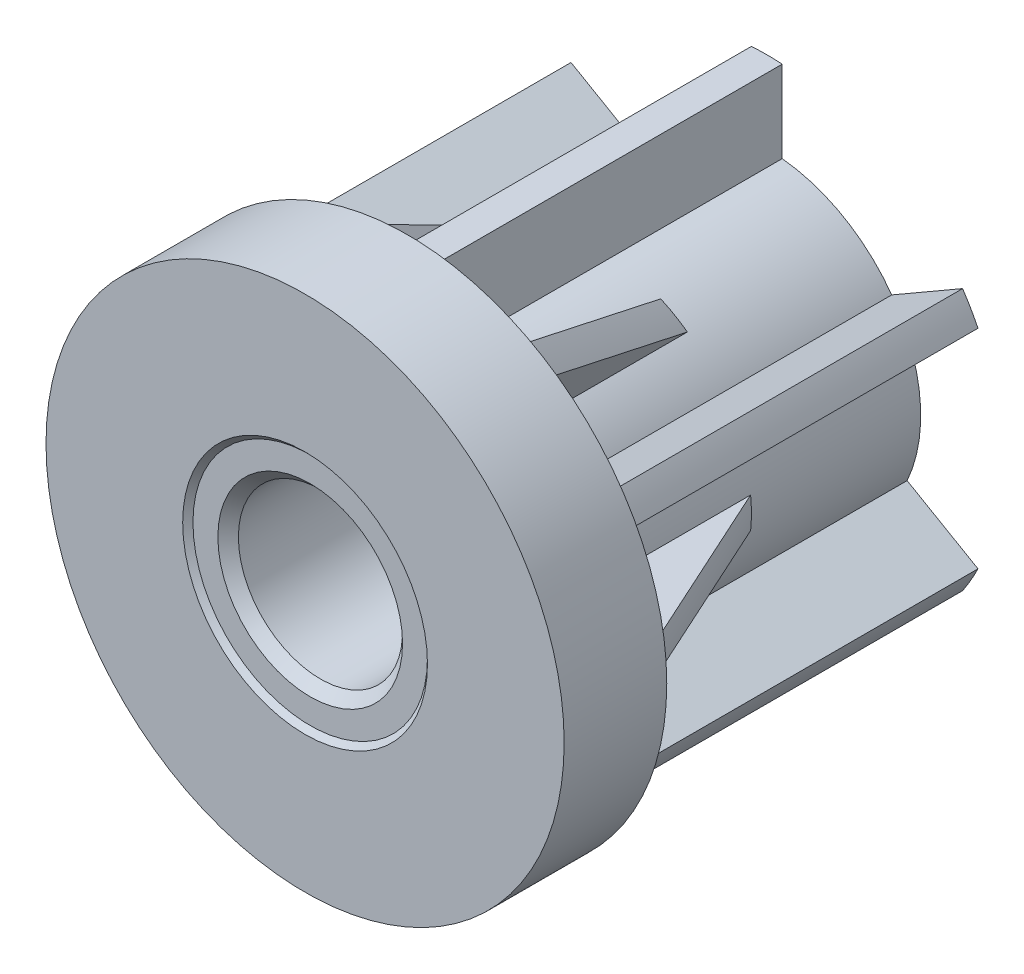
ISO-10303-21;
HEADER;
FILE_DESCRIPTION(('STEP AP214'),'2;1');
FILE_NAME('part.step','',(''),(''),'','','');
FILE_SCHEMA(('AUTOMOTIVE_DESIGN { 1 0 10303 214 1 1 1 1 }'));
ENDSEC;
DATA;
#1=APPLICATION_CONTEXT('core data for automotive mechanical design processes');
#2=APPLICATION_PROTOCOL_DEFINITION('international standard','automotive_design',2000,#1);
#3=PRODUCT_CONTEXT('',#1,'mechanical');
#4=PRODUCT('Part','Part','',(#3));
#5=PRODUCT_RELATED_PRODUCT_CATEGORY('part','',(#4));
#6=PRODUCT_DEFINITION_FORMATION('','',#4);
#7=PRODUCT_DEFINITION_CONTEXT('part definition',#1,'design');
#8=PRODUCT_DEFINITION('design','',#6,#7);
#9=PRODUCT_DEFINITION_SHAPE('','',#8);
#10=(LENGTH_UNIT() NAMED_UNIT(*) SI_UNIT(.MILLI.,.METRE.));
#11=(NAMED_UNIT(*) PLANE_ANGLE_UNIT() SI_UNIT($,.RADIAN.));
#12=(NAMED_UNIT(*) SI_UNIT($,.STERADIAN.) SOLID_ANGLE_UNIT());
#13=UNCERTAINTY_MEASURE_WITH_UNIT(LENGTH_MEASURE(1.E-05),#10,'distance_accuracy_value','');
#14=(GEOMETRIC_REPRESENTATION_CONTEXT(3) GLOBAL_UNCERTAINTY_ASSIGNED_CONTEXT((#13)) GLOBAL_UNIT_ASSIGNED_CONTEXT((#10,
#11,#12)) REPRESENTATION_CONTEXT('',''));
#15=CARTESIAN_POINT('',(0.,0.,0.));
#16=DIRECTION('',(0.,0.,1.));
#17=DIRECTION('',(1.,0.,0.));
#18=AXIS2_PLACEMENT_3D('',#15,#16,#17);
#19=CARTESIAN_POINT('',(0.,0.,-9.));
#20=DIRECTION('',(0.,0.,-1.));
#21=DIRECTION('',(-1.,0.,0.));
#22=AXIS2_PLACEMENT_3D('',#19,#20,#21);
#23=CYLINDRICAL_SURFACE('',#22,9.25);
#24=CARTESIAN_POINT('',(0.,0.,-13.));
#25=DIRECTION('',(0.,0.,-1.));
#26=DIRECTION('',(-1.,0.,0.));
#27=AXIS2_PLACEMENT_3D('',#24,#25,#26);
#28=CIRCLE('',#27,9.25);
#29=CARTESIAN_POINT('',(-9.25,0.,-13.));
#30=VERTEX_POINT('',#29);
#31=EDGE_CURVE('E1486',#30,#30,#28,.T.);
#32=ORIENTED_EDGE('',*,*,#31,.T.);
#33=EDGE_LOOP('',(#32));
#34=FACE_BOUND('',#33,.T.);
#35=CARTESIAN_POINT('',(0.,0.,-5.));
#36=DIRECTION('',(0.,0.,-1.));
#37=DIRECTION('',(-1.,0.,0.));
#38=AXIS2_PLACEMENT_3D('',#35,#36,#37);
#39=CIRCLE('',#38,9.25);
#40=CARTESIAN_POINT('',(-9.25,0.,-5.));
#41=VERTEX_POINT('',#40);
#42=EDGE_CURVE('E1489',#41,#41,#39,.F.);
#43=ORIENTED_EDGE('',*,*,#42,.T.);
#44=EDGE_LOOP('',(#43));
#45=FACE_BOUND('',#44,.T.);
#46=ADVANCED_FACE('F14',(#34,#45),#23,.F.);
#47=CARTESIAN_POINT('',(0.,8.625,-5.));
#48=DIRECTION('',(0.,0.,1.));
#49=DIRECTION('',(1.,0.,0.));
#50=AXIS2_PLACEMENT_3D('',#47,#48,#49);
#51=PLANE('',#50);
#52=ORIENTED_EDGE('',*,*,#42,.F.);
#53=EDGE_LOOP('',(#52));
#54=FACE_BOUND('',#53,.T.);
#55=CARTESIAN_POINT('',(0.,0.,-5.));
#56=DIRECTION('',(0.,0.,-1.));
#57=DIRECTION('',(-1.,0.,0.));
#58=AXIS2_PLACEMENT_3D('',#55,#56,#57);
#59=CIRCLE('',#58,8.);
#60=CARTESIAN_POINT('',(-8.,0.,-5.));
#61=VERTEX_POINT('',#60);
#62=EDGE_CURVE('E1481',#61,#61,#59,.F.);
#63=ORIENTED_EDGE('',*,*,#62,.T.);
#64=EDGE_LOOP('',(#63));
#65=FACE_BOUND('',#64,.T.);
#66=ADVANCED_FACE('F1408',(#54,#65),#51,.F.);
#67=CARTESIAN_POINT('',(0.,9.875,-13.));
#68=DIRECTION('',(0.,0.,1.));
#69=DIRECTION('',(1.,0.,0.));
#70=AXIS2_PLACEMENT_3D('',#67,#68,#69);
#71=PLANE('',#70);
#72=CARTESIAN_POINT('',(0.,0.,-13.));
#73=DIRECTION('',(0.,0.,-1.));
#74=DIRECTION('',(-1.,0.,0.));
#75=AXIS2_PLACEMENT_3D('',#72,#73,#74);
#76=CIRCLE('',#75,10.5);
#77=CARTESIAN_POINT('',(-10.5,0.,-13.));
#78=VERTEX_POINT('',#77);
#79=EDGE_CURVE('E1478',#78,#78,#76,.T.);
#80=ORIENTED_EDGE('',*,*,#79,.T.);
#81=EDGE_LOOP('',(#80));
#82=FACE_BOUND('',#81,.T.);
#83=ORIENTED_EDGE('',*,*,#31,.F.);
#84=EDGE_LOOP('',(#83));
#85=FACE_BOUND('',#84,.T.);
#86=ADVANCED_FACE('F1417',(#82,#85),#71,.F.);
#87=CARTESIAN_POINT('',(0.,0.,-24.));
#88=DIRECTION('',(0.,0.,-1.));
#89=DIRECTION('',(-1.,0.,0.));
#90=AXIS2_PLACEMENT_3D('',#87,#88,#89);
#91=CYLINDRICAL_SURFACE('',#90,10.5);
#92=ORIENTED_EDGE('',*,*,#79,.F.);
#93=EDGE_LOOP('',(#92));
#94=FACE_BOUND('',#93,.T.);
#95=CARTESIAN_POINT('',(0.,0.,-35.));
#96=DIRECTION('',(0.,0.,-1.));
#97=DIRECTION('',(-1.,0.,0.));
#98=AXIS2_PLACEMENT_3D('',#95,#96,#97);
#99=CIRCLE('',#98,10.5);
#100=CARTESIAN_POINT('',(-10.5,0.,-35.));
#101=VERTEX_POINT('',#100);
#102=EDGE_CURVE('E357',#101,#101,#99,.F.);
#103=ORIENTED_EDGE('',*,*,#102,.F.);
#104=EDGE_LOOP('',(#103));
#105=FACE_BOUND('',#104,.T.);
#106=ADVANCED_FACE('F1427',(#94,#105),#91,.F.);
#107=CARTESIAN_POINT('',(0.,0.,-1.));
#108=DIRECTION('',(0.,0.,1.));
#109=DIRECTION('',(1.,0.,0.));
#110=AXIS2_PLACEMENT_3D('',#107,#108,#109);
#111=CONICAL_SURFACE('',#110,22.95,0.426412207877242);
#112=CARTESIAN_POINT('',(-22.900927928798,-1.5,-1.));
#113=CARTESIAN_POINT('',(-22.2368742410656,-1.5,-2.45861707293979));
#114=CARTESIAN_POINT('',(-21.5727264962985,-1.5,-3.91719133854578));
#115=CARTESIAN_POINT('',(-20.2441600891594,-1.5,-6.8342163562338));
#116=CARTESIAN_POINT('',(-19.579741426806,-1.5,-8.29266710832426));
#117=CARTESIAN_POINT('',(-18.2505502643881,-1.5,-11.2094074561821));
#118=CARTESIAN_POINT('',(-17.5857777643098,-1.5,-12.6676970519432));
#119=CARTESIAN_POINT('',(-16.255719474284,-1.5,-15.5840422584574));
#120=CARTESIAN_POINT('',(-15.5904336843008,-1.5,-17.0420978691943));
#121=CARTESIAN_POINT('',(-14.9248115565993,-1.5,-18.5));
#122=B_SPLINE_CURVE_WITH_KNOTS('',3,(#112,#113,#114,#115,#116,#117,#118,#119,#120,#121),
.UNSPECIFIED.,.F.,.F.,(4,2,2,2,4),(0.,4.80799123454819,9.61598214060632,14.4239732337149,
19.2319646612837),.UNSPECIFIED.);
#123=CARTESIAN_POINT('',(-22.900927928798,-1.5,-1.));
#124=VERTEX_POINT('',#123);
#125=CARTESIAN_POINT('',(-14.9248115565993,-1.5,-18.5));
#126=VERTEX_POINT('',#125);
#127=EDGE_CURVE('E760',#124,#126,#122,.T.);
#128=ORIENTED_EDGE('',*,*,#127,.F.);
#129=CARTESIAN_POINT('',(1.15459477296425E-12,3.1996627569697E-13,-1.));
#130=DIRECTION('',(0.,0.,1.));
#131=DIRECTION('',(1.,0.,0.));
#132=AXIS2_PLACEMENT_3D('',#129,#130,#131);
#133=CIRCLE('',#132,22.9500000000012);
#134=CARTESIAN_POINT('',(-22.9009279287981,1.5,-1.));
#135=VERTEX_POINT('',#134);
#136=EDGE_CURVE('E439',#135,#124,#133,.T.);
#137=ORIENTED_EDGE('',*,*,#136,.F.);
#138=CARTESIAN_POINT('',(-14.9248115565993,1.5,-18.5));
#139=CARTESIAN_POINT('',(-15.5904336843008,1.5,-17.0420978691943));
#140=CARTESIAN_POINT('',(-16.255719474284,1.5,-15.5840422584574));
#141=CARTESIAN_POINT('',(-17.5857777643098,1.5,-12.6676970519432));
#142=CARTESIAN_POINT('',(-18.2505502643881,1.5,-11.2094074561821));
#143=CARTESIAN_POINT('',(-19.579741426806,1.5,-8.29266710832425));
#144=CARTESIAN_POINT('',(-20.2441600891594,1.5,-6.83421635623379));
#145=CARTESIAN_POINT('',(-21.5727264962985,1.5,-3.91719133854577));
#146=CARTESIAN_POINT('',(-22.2368742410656,1.5,-2.45861707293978));
#147=CARTESIAN_POINT('',(-22.900927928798,1.5,-0.999999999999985));
#148=B_SPLINE_CURVE_WITH_KNOTS('',3,(#138,#139,#140,#141,#142,#143,#144,#145,#146,#147),
.UNSPECIFIED.,.F.,.F.,(4,2,2,2,4),(0.,4.80799142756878,9.61598252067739,14.4239734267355,
19.2319646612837),.UNSPECIFIED.);
#149=CARTESIAN_POINT('',(-14.9248115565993,1.5,-18.5));
#150=VERTEX_POINT('',#149);
#151=EDGE_CURVE('E336',#150,#135,#148,.T.);
#152=ORIENTED_EDGE('',*,*,#151,.F.);
#153=CARTESIAN_POINT('',(0.,0.,-18.5));
#154=DIRECTION('',(0.,0.,-1.));
#155=DIRECTION('',(-1.,0.,0.));
#156=AXIS2_PLACEMENT_3D('',#153,#154,#155);
#157=CIRCLE('',#156,15.);
#158=EDGE_CURVE('E434',#126,#150,#157,.T.);
#159=ORIENTED_EDGE('',*,*,#158,.F.);
#160=EDGE_LOOP('',(#128,#137,#152,#159));
#161=FACE_BOUND('',#160,.T.);
#162=ADVANCED_FACE('F706',(#161),#111,.T.);
#163=CARTESIAN_POINT('',(0.,0.,-1.));
#164=DIRECTION('',(0.,0.,1.));
#165=DIRECTION('',(1.,0.,0.));
#166=AXIS2_PLACEMENT_3D('',#163,#164,#165);
#167=CONICAL_SURFACE('',#166,22.95,0.426412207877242);
#168=CARTESIAN_POINT('',(-10.1514258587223,-20.5827853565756,-1.));
#169=CARTESIAN_POINT('',(-9.81939901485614,-20.0076979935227,-2.45861707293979));
#170=CARTESIAN_POINT('',(-9.48732514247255,-19.4325291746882,-3.91719133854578));
#171=CARTESIAN_POINT('',(-8.82304193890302,-18.2819569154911,-6.83421635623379));
#172=CARTESIAN_POINT('',(-8.49083260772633,-17.7065534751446,-8.29266710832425));
#173=CARTESIAN_POINT('',(-7.82623702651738,-16.5554401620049,-11.2094074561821));
#174=CARTESIAN_POINT('',(-7.49385077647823,-15.9797302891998,-12.6676970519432));
#175=CARTESIAN_POINT('',(-6.82882163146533,-14.8278660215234,-15.5840422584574));
#176=CARTESIAN_POINT('',(-6.49617873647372,-14.2517116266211,-17.0420978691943));
#177=CARTESIAN_POINT('',(-6.16336767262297,-13.6752659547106,-18.5));
#178=B_SPLINE_CURVE_WITH_KNOTS('',3,(#168,#169,#170,#171,#172,#173,#174,#175,#176,#177),
.UNSPECIFIED.,.F.,.F.,(4,2,2,2,4),(0.,4.80799123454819,9.61598214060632,14.4239732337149,
19.2319646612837),.UNSPECIFIED.);
#179=CARTESIAN_POINT('',(-10.1514258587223,-20.5827853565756,-1.));
#180=VERTEX_POINT('',#179);
#181=CARTESIAN_POINT('',(-6.16336767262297,-13.6752659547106,-18.5));
#182=VERTEX_POINT('',#181);
#183=EDGE_CURVE('E712',#180,#182,#178,.T.);
#184=ORIENTED_EDGE('',*,*,#183,.F.);
#185=CARTESIAN_POINT('',(6.90965637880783E-13,1.05160324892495E-12,-1.));
#186=DIRECTION('',(0.,0.,1.));
#187=DIRECTION('',(1.,0.,0.));
#188=AXIS2_PLACEMENT_3D('',#185,#186,#187);
#189=CIRCLE('',#188,22.9500000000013);
#190=CARTESIAN_POINT('',(-12.7495020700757,-19.0827853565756,-1.));
#191=VERTEX_POINT('',#190);
#192=EDGE_CURVE('E426',#191,#180,#189,.T.);
#193=ORIENTED_EDGE('',*,*,#192,.F.);
#194=CARTESIAN_POINT('',(-8.76144388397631,-12.1752659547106,-18.5));
#195=CARTESIAN_POINT('',(-9.09425494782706,-12.7517116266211,-17.0420978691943));
#196=CARTESIAN_POINT('',(-9.42689784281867,-13.3278660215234,-15.5840422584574));
#197=CARTESIAN_POINT('',(-10.0919269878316,-14.4797302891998,-12.6676970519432));
#198=CARTESIAN_POINT('',(-10.4243132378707,-15.0554401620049,-11.2094074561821));
#199=CARTESIAN_POINT('',(-11.0889088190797,-16.2065534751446,-8.29266710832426));
#200=CARTESIAN_POINT('',(-11.4211181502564,-16.7819569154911,-6.83421635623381));
#201=CARTESIAN_POINT('',(-12.0854013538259,-17.9325291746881,-3.91719133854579));
#202=CARTESIAN_POINT('',(-12.4174752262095,-18.5076979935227,-2.4586170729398));
#203=CARTESIAN_POINT('',(-12.7495020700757,-19.0827853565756,-1.));
#204=B_SPLINE_CURVE_WITH_KNOTS('',3,(#194,#195,#196,#197,#198,#199,#200,#201,#202,#203),
.UNSPECIFIED.,.F.,.F.,(4,2,2,2,4),(0.,4.80799142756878,9.61598252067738,14.4239734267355,
19.2319646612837),.UNSPECIFIED.);
#205=CARTESIAN_POINT('',(-8.7614438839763,-12.1752659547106,-18.5));
#206=VERTEX_POINT('',#205);
#207=EDGE_CURVE('E424',#206,#191,#204,.T.);
#208=ORIENTED_EDGE('',*,*,#207,.F.);
#209=CARTESIAN_POINT('',(0.,0.,-18.5));
#210=DIRECTION('',(0.,0.,-1.));
#211=DIRECTION('',(-1.,0.,0.));
#212=AXIS2_PLACEMENT_3D('',#209,#210,#211);
#213=CIRCLE('',#212,15.);
#214=EDGE_CURVE('E417',#182,#206,#213,.T.);
#215=ORIENTED_EDGE('',*,*,#214,.F.);
#216=EDGE_LOOP('',(#184,#193,#208,#215));
#217=FACE_BOUND('',#216,.T.);
#218=ADVANCED_FACE('F700',(#217),#167,.T.);
#219=CARTESIAN_POINT('',(0.,0.,-0.999999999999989));
#220=DIRECTION('',(0.,0.,1.));
#221=DIRECTION('',(1.,0.,0.));
#222=AXIS2_PLACEMENT_3D('',#219,#220,#221);
#223=CONICAL_SURFACE('',#222,22.95,0.426412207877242);
#224=CARTESIAN_POINT('',(12.7495020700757,-19.0827853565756,-1.));
#225=CARTESIAN_POINT('',(12.4174752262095,-18.5076979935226,-2.45861707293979));
#226=CARTESIAN_POINT('',(12.0854013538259,-17.9325291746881,-3.91719133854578));
#227=CARTESIAN_POINT('',(11.4211181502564,-16.7819569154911,-6.8342163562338));
#228=CARTESIAN_POINT('',(11.0889088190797,-16.2065534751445,-8.29266710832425));
#229=CARTESIAN_POINT('',(10.4243132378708,-15.0554401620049,-11.2094074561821));
#230=CARTESIAN_POINT('',(10.0919269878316,-14.4797302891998,-12.6676970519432));
#231=CARTESIAN_POINT('',(9.42689784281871,-13.3278660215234,-15.5840422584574));
#232=CARTESIAN_POINT('',(9.0942549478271,-12.7517116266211,-17.0420978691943));
#233=CARTESIAN_POINT('',(8.76144388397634,-12.1752659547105,-18.5));
#234=B_SPLINE_CURVE_WITH_KNOTS('',3,(#224,#225,#226,#227,#228,#229,#230,#231,#232,#233),
.UNSPECIFIED.,.F.,.F.,(4,2,2,2,4),(0.,4.80799123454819,9.61598214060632,14.4239732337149,
19.2319646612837),.UNSPECIFIED.);
#235=CARTESIAN_POINT('',(12.7495020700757,-19.0827853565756,-1.));
#236=VERTEX_POINT('',#235);
#237=CARTESIAN_POINT('',(8.76144388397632,-12.1752659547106,-18.5));
#238=VERTEX_POINT('',#237);
#239=EDGE_CURVE('E683',#236,#238,#234,.T.);
#240=ORIENTED_EDGE('',*,*,#239,.F.);
#241=CARTESIAN_POINT('',(-3.49979470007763E-13,0.,-1.));
#242=DIRECTION('',(0.,0.,1.));
#243=DIRECTION('',(1.,0.,0.));
#244=AXIS2_PLACEMENT_3D('',#241,#242,#243);
#245=CIRCLE('',#244,22.95);
#246=CARTESIAN_POINT('',(10.1514258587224,-20.5827853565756,-1.));
#247=VERTEX_POINT('',#246);
#248=EDGE_CURVE('E409',#247,#236,#245,.T.);
#249=ORIENTED_EDGE('',*,*,#248,.F.);
#250=CARTESIAN_POINT('',(6.16336767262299,-13.6752659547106,-18.5));
#251=CARTESIAN_POINT('',(6.49617873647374,-14.2517116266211,-17.0420978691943));
#252=CARTESIAN_POINT('',(6.82882163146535,-14.8278660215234,-15.5840422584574));
#253=CARTESIAN_POINT('',(7.49385077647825,-15.9797302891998,-12.6676970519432));
#254=CARTESIAN_POINT('',(7.82623702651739,-16.5554401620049,-11.2094074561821));
#255=CARTESIAN_POINT('',(8.49083260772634,-17.7065534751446,-8.29266710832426));
#256=CARTESIAN_POINT('',(8.82304193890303,-18.2819569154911,-6.8342163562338));
#257=CARTESIAN_POINT('',(9.48732514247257,-19.4325291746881,-3.91719133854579));
#258=CARTESIAN_POINT('',(9.81939901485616,-20.0076979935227,-2.45861707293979));
#259=CARTESIAN_POINT('',(10.1514258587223,-20.5827853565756,-1.));
#260=B_SPLINE_CURVE_WITH_KNOTS('',3,(#250,#251,#252,#253,#254,#255,#256,#257,#258,#259),
.UNSPECIFIED.,.F.,.F.,(4,2,2,2,4),(0.,4.80799142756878,9.61598252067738,14.4239734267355,
19.2319646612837),.UNSPECIFIED.);
#261=CARTESIAN_POINT('',(6.16336767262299,-13.6752659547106,-18.5));
#262=VERTEX_POINT('',#261);
#263=EDGE_CURVE('E407',#262,#247,#260,.T.);
#264=ORIENTED_EDGE('',*,*,#263,.F.);
#265=CARTESIAN_POINT('',(0.,0.,-18.5));
#266=DIRECTION('',(0.,0.,-1.));
#267=DIRECTION('',(-1.,0.,0.));
#268=AXIS2_PLACEMENT_3D('',#265,#266,#267);
#269=CIRCLE('',#268,15.);
#270=EDGE_CURVE('E400',#238,#262,#269,.T.);
#271=ORIENTED_EDGE('',*,*,#270,.F.);
#272=EDGE_LOOP('',(#240,#249,#264,#271));
#273=FACE_BOUND('',#272,.T.);
#274=ADVANCED_FACE('F696',(#273),#223,.T.);
#275=CARTESIAN_POINT('',(0.,0.,-0.999999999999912));
#276=DIRECTION('',(0.,0.,1.));
#277=DIRECTION('',(1.,0.,0.));
#278=AXIS2_PLACEMENT_3D('',#275,#276,#277);
#279=CONICAL_SURFACE('',#278,22.95,0.426412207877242);
#280=CARTESIAN_POINT('',(14.9248115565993,-1.5,-18.5));
#281=CARTESIAN_POINT('',(15.5904336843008,-1.5,-17.0420978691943));
#282=CARTESIAN_POINT('',(16.255719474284,-1.5,-15.5840422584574));
#283=CARTESIAN_POINT('',(17.5857777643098,-1.5,-12.6676970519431));
#284=CARTESIAN_POINT('',(18.2505502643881,-1.5,-11.209407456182));
#285=CARTESIAN_POINT('',(19.579741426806,-1.5,-8.29266710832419));
#286=CARTESIAN_POINT('',(20.2441600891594,-1.5,-6.83421635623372));
#287=CARTESIAN_POINT('',(21.5727264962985,-1.5,-3.9171913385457));
#288=CARTESIAN_POINT('',(22.2368742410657,-1.5,-2.4586170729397));
#289=CARTESIAN_POINT('',(22.9009279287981,-1.5,-0.999999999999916));
#290=B_SPLINE_CURVE_WITH_KNOTS('',3,(#280,#281,#282,#283,#284,#285,#286,#287,#288,#289),
.UNSPECIFIED.,.F.,.F.,(4,2,2,2,4),(0.,4.8079914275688,9.61598252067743,14.4239734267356,
19.2319646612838),.UNSPECIFIED.);
#291=CARTESIAN_POINT('',(14.9248115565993,-1.5,-18.5));
#292=VERTEX_POINT('',#291);
#293=CARTESIAN_POINT('',(22.9009279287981,-1.5,-0.999999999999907));
#294=VERTEX_POINT('',#293);
#295=EDGE_CURVE('E385',#292,#294,#290,.T.);
#296=ORIENTED_EDGE('',*,*,#295,.F.);
#297=CARTESIAN_POINT('',(0.,0.,-18.5));
#298=DIRECTION('',(0.,0.,-1.));
#299=DIRECTION('',(-1.,0.,0.));
#300=AXIS2_PLACEMENT_3D('',#297,#298,#299);
#301=CIRCLE('',#300,15.);
#302=CARTESIAN_POINT('',(14.9248115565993,1.5,-18.5));
#303=VERTEX_POINT('',#302);
#304=EDGE_CURVE('E387',#303,#292,#301,.T.);
#305=ORIENTED_EDGE('',*,*,#304,.F.);
#306=CARTESIAN_POINT('',(22.900927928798,1.5,-0.999999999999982));
#307=CARTESIAN_POINT('',(22.2368742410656,1.5,-2.45861707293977));
#308=CARTESIAN_POINT('',(21.5727264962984,1.5,-3.91719133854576));
#309=CARTESIAN_POINT('',(20.2441600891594,1.5,-6.83421635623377));
#310=CARTESIAN_POINT('',(19.579741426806,1.5,-8.29266710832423));
#311=CARTESIAN_POINT('',(18.2505502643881,1.5,-11.2094074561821));
#312=CARTESIAN_POINT('',(17.5857777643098,1.5,-12.6676970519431));
#313=CARTESIAN_POINT('',(16.255719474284,1.5,-15.5840422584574));
#314=CARTESIAN_POINT('',(15.5904336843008,1.5,-17.0420978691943));
#315=CARTESIAN_POINT('',(14.9248115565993,1.5,-18.5));
#316=B_SPLINE_CURVE_WITH_KNOTS('',3,(#306,#307,#308,#309,#310,#311,#312,#313,#314,#315),
.UNSPECIFIED.,.F.,.F.,(4,2,2,2,4),(0.,4.80799123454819,9.61598214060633,14.4239732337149,
19.2319646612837),.UNSPECIFIED.);
#317=CARTESIAN_POINT('',(22.900927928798,1.5,-0.99999999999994));
#318=VERTEX_POINT('',#317);
#319=EDGE_CURVE('E638',#318,#303,#316,.T.);
#320=ORIENTED_EDGE('',*,*,#319,.F.);
#321=CARTESIAN_POINT('',(-2.98465121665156E-13,-2.20268248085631E-13,-0.9999999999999));
#322=DIRECTION('',(0.,0.,1.));
#323=DIRECTION('',(1.,0.,0.));
#324=AXIS2_PLACEMENT_3D('',#321,#322,#323);
#325=CIRCLE('',#324,22.9500000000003);
#326=EDGE_CURVE('E392',#294,#318,#325,.T.);
#327=ORIENTED_EDGE('',*,*,#326,.F.);
#328=EDGE_LOOP('',(#296,#305,#320,#327));
#329=FACE_BOUND('',#328,.T.);
#330=ADVANCED_FACE('F584',(#329),#279,.T.);
#331=CARTESIAN_POINT('',(0.,0.,-1.));
#332=DIRECTION('',(0.,0.,1.));
#333=DIRECTION('',(1.,0.,0.));
#334=AXIS2_PLACEMENT_3D('',#331,#332,#333);
#335=CONICAL_SURFACE('',#334,22.95,0.426412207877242);
#336=CARTESIAN_POINT('',(10.1514258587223,20.5827853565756,-1.00000000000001));
#337=CARTESIAN_POINT('',(9.81939901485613,20.0076979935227,-2.45861707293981));
#338=CARTESIAN_POINT('',(9.48732514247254,19.4325291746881,-3.9171913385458));
#339=CARTESIAN_POINT('',(8.82304193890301,18.2819569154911,-6.83421635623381));
#340=CARTESIAN_POINT('',(8.49083260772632,17.7065534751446,-8.29266710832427));
#341=CARTESIAN_POINT('',(7.82623702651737,16.5554401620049,-11.2094074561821));
#342=CARTESIAN_POINT('',(7.49385077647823,15.9797302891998,-12.6676970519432));
#343=CARTESIAN_POINT('',(6.82882163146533,14.8278660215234,-15.5840422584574));
#344=CARTESIAN_POINT('',(6.49617873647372,14.2517116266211,-17.0420978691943));
#345=CARTESIAN_POINT('',(6.16336767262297,13.6752659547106,-18.5));
#346=B_SPLINE_CURVE_WITH_KNOTS('',3,(#336,#337,#338,#339,#340,#341,#342,#343,#344,#345),
.UNSPECIFIED.,.F.,.F.,(4,2,2,2,4),(0.,4.80799123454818,9.61598214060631,14.4239732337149,
19.2319646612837),.UNSPECIFIED.);
#347=CARTESIAN_POINT('',(10.1514258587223,20.5827853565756,-1.));
#348=VERTEX_POINT('',#347);
#349=CARTESIAN_POINT('',(6.16336767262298,13.6752659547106,-18.5));
#350=VERTEX_POINT('',#349);
#351=EDGE_CURVE('E590',#348,#350,#346,.T.);
#352=ORIENTED_EDGE('',*,*,#351,.F.);
#353=CARTESIAN_POINT('',(-1.1372401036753E-13,3.62376795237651E-13,-1.));
#354=DIRECTION('',(0.,0.,1.));
#355=DIRECTION('',(1.,0.,0.));
#356=AXIS2_PLACEMENT_3D('',#353,#354,#355);
#357=CIRCLE('',#356,22.9499999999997);
#358=CARTESIAN_POINT('',(12.7495020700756,19.0827853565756,-1.));
#359=VERTEX_POINT('',#358);
#360=EDGE_CURVE('E375',#359,#348,#357,.T.);
#361=ORIENTED_EDGE('',*,*,#360,.F.);
#362=CARTESIAN_POINT('',(8.76144388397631,12.1752659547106,-18.5));
#363=CARTESIAN_POINT('',(9.09425494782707,12.7517116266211,-17.0420978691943));
#364=CARTESIAN_POINT('',(9.42689784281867,13.3278660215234,-15.5840422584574));
#365=CARTESIAN_POINT('',(10.0919269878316,14.4797302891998,-12.6676970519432));
#366=CARTESIAN_POINT('',(10.4243132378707,15.0554401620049,-11.2094074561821));
#367=CARTESIAN_POINT('',(11.0889088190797,16.2065534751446,-8.29266710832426));
#368=CARTESIAN_POINT('',(11.4211181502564,16.7819569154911,-6.83421635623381));
#369=CARTESIAN_POINT('',(12.0854013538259,17.9325291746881,-3.91719133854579));
#370=CARTESIAN_POINT('',(12.4174752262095,18.5076979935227,-2.4586170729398));
#371=CARTESIAN_POINT('',(12.7495020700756,19.0827853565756,-1.));
#372=B_SPLINE_CURVE_WITH_KNOTS('',3,(#362,#363,#364,#365,#366,#367,#368,#369,#370,#371),
.UNSPECIFIED.,.F.,.F.,(4,2,2,2,4),(0.,4.80799142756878,9.61598252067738,14.4239734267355,
19.2319646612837),.UNSPECIFIED.);
#373=CARTESIAN_POINT('',(8.7614438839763,12.1752659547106,-18.5));
#374=VERTEX_POINT('',#373);
#375=EDGE_CURVE('E368',#374,#359,#372,.T.);
#376=ORIENTED_EDGE('',*,*,#375,.F.);
#377=CARTESIAN_POINT('',(0.,0.,-18.5));
#378=DIRECTION('',(0.,0.,-1.));
#379=DIRECTION('',(-1.,0.,0.));
#380=AXIS2_PLACEMENT_3D('',#377,#378,#379);
#381=CIRCLE('',#380,15.);
#382=EDGE_CURVE('E370',#350,#374,#381,.T.);
#383=ORIENTED_EDGE('',*,*,#382,.F.);
#384=EDGE_LOOP('',(#352,#361,#376,#383));
#385=FACE_BOUND('',#384,.T.);
#386=ADVANCED_FACE('F577',(#385),#335,.T.);
#387=CARTESIAN_POINT('',(0.,0.,-0.999999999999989));
#388=DIRECTION('',(0.,0.,1.));
#389=DIRECTION('',(1.,0.,0.));
#390=AXIS2_PLACEMENT_3D('',#387,#388,#389);
#391=CONICAL_SURFACE('',#390,22.95,0.426412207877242);
#392=CARTESIAN_POINT('',(-12.7495020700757,19.0827853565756,-1.));
#393=CARTESIAN_POINT('',(-12.4174752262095,18.5076979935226,-2.45861707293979));
#394=CARTESIAN_POINT('',(-12.0854013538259,17.9325291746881,-3.91719133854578));
#395=CARTESIAN_POINT('',(-11.4211181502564,16.7819569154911,-6.83421635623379));
#396=CARTESIAN_POINT('',(-11.0889088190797,16.2065534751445,-8.29266710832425));
#397=CARTESIAN_POINT('',(-10.4243132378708,15.0554401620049,-11.2094074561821));
#398=CARTESIAN_POINT('',(-10.0919269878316,14.4797302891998,-12.6676970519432));
#399=CARTESIAN_POINT('',(-9.42689784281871,13.3278660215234,-15.5840422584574));
#400=CARTESIAN_POINT('',(-9.0942549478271,12.7517116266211,-17.0420978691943));
#401=CARTESIAN_POINT('',(-8.76144388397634,12.1752659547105,-18.5));
#402=B_SPLINE_CURVE_WITH_KNOTS('',3,(#392,#393,#394,#395,#396,#397,#398,#399,#400,#401),
.UNSPECIFIED.,.F.,.F.,(4,2,2,2,4),(0.,4.80799123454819,9.61598214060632,14.4239732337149,
19.2319646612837),.UNSPECIFIED.);
#403=CARTESIAN_POINT('',(-12.7495020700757,19.0827853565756,-1.));
#404=VERTEX_POINT('',#403);
#405=CARTESIAN_POINT('',(-8.76144388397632,12.1752659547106,-18.5));
#406=VERTEX_POINT('',#405);
#407=EDGE_CURVE('E553',#404,#406,#402,.T.);
#408=ORIENTED_EDGE('',*,*,#407,.F.);
#409=CARTESIAN_POINT('',(6.16358650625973E-13,-1.37490019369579E-12,-1.));
#410=DIRECTION('',(0.,0.,1.));
#411=DIRECTION('',(1.,0.,0.));
#412=AXIS2_PLACEMENT_3D('',#409,#410,#411);
#413=CIRCLE('',#412,22.9500000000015);
#414=CARTESIAN_POINT('',(-10.1514258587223,20.5827853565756,-1.));
#415=VERTEX_POINT('',#414);
#416=EDGE_CURVE('E358',#415,#404,#413,.T.);
#417=ORIENTED_EDGE('',*,*,#416,.F.);
#418=CARTESIAN_POINT('',(-6.16336767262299,13.6752659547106,-18.5));
#419=CARTESIAN_POINT('',(-6.49617873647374,14.2517116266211,-17.0420978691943));
#420=CARTESIAN_POINT('',(-6.82882163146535,14.8278660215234,-15.5840422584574));
#421=CARTESIAN_POINT('',(-7.49385077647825,15.9797302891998,-12.6676970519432));
#422=CARTESIAN_POINT('',(-7.82623702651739,16.5554401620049,-11.2094074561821));
#423=CARTESIAN_POINT('',(-8.49083260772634,17.7065534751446,-8.29266710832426));
#424=CARTESIAN_POINT('',(-8.82304193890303,18.2819569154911,-6.8342163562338));
#425=CARTESIAN_POINT('',(-9.48732514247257,19.4325291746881,-3.91719133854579));
#426=CARTESIAN_POINT('',(-9.81939901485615,20.0076979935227,-2.45861707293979));
#427=CARTESIAN_POINT('',(-10.1514258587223,20.5827853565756,-1.));
#428=B_SPLINE_CURVE_WITH_KNOTS('',3,(#418,#419,#420,#421,#422,#423,#424,#425,#426,#427),
.UNSPECIFIED.,.F.,.F.,(4,2,2,2,4),(0.,4.80799142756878,9.61598252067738,14.4239734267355,
19.2319646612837),.UNSPECIFIED.);
#429=CARTESIAN_POINT('',(-6.16336767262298,13.6752659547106,-18.5));
#430=VERTEX_POINT('',#429);
#431=EDGE_CURVE('E350',#430,#415,#428,.T.);
#432=ORIENTED_EDGE('',*,*,#431,.F.);
#433=CARTESIAN_POINT('',(0.,0.,-18.5));
#434=DIRECTION('',(0.,0.,-1.));
#435=DIRECTION('',(-1.,0.,0.));
#436=AXIS2_PLACEMENT_3D('',#433,#434,#435);
#437=CIRCLE('',#436,15.);
#438=EDGE_CURVE('E352',#406,#430,#437,.T.);
#439=ORIENTED_EDGE('',*,*,#438,.F.);
#440=EDGE_LOOP('',(#408,#417,#432,#439));
#441=FACE_BOUND('',#440,.T.);
#442=ADVANCED_FACE('F572',(#441),#391,.T.);
#443=CARTESIAN_POINT('',(0.,7.5,-35.));
#444=DIRECTION('',(0.,0.,-1.));
#445=DIRECTION('',(-1.,0.,0.));
#446=AXIS2_PLACEMENT_3D('',#443,#444,#445);
#447=PLANE('',#446);
#448=ORIENTED_EDGE('',*,*,#102,.T.);
#449=EDGE_LOOP('',(#448));
#450=FACE_BOUND('',#449,.T.);
#451=CARTESIAN_POINT('',(1.19491222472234E-13,0.,-35.));
#452=DIRECTION('',(0.,0.,1.));
#453=DIRECTION('',(1.,0.,0.));
#454=AXIS2_PLACEMENT_3D('',#451,#452,#453);
#455=CIRCLE('',#454,22.95);
#456=CARTESIAN_POINT('',(-19.0827853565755,12.7495020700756,-35.));
#457=VERTEX_POINT('',#456);
#458=CARTESIAN_POINT('',(-20.5827853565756,10.1514258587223,-35.));
#459=VERTEX_POINT('',#458);
#460=EDGE_CURVE('E319',#457,#459,#455,.T.);
#461=ORIENTED_EDGE('',*,*,#460,.F.);
#462=DIRECTION('',(0.866025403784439,-0.5,0.));
#463=VECTOR('',#462,1.);
#464=CARTESIAN_POINT('',(-6.9352130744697,5.73609794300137,-35.));
#465=LINE('',#464,#463);
#466=CARTESIAN_POINT('',(-12.1752659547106,8.7614438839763,-35.));
#467=VERTEX_POINT('',#466);
#468=EDGE_CURVE('E314',#467,#457,#465,.F.);
#469=ORIENTED_EDGE('',*,*,#468,.F.);
#470=CARTESIAN_POINT('',(0.,0.,-35.));
#471=DIRECTION('',(0.,0.,-1.));
#472=DIRECTION('',(-1.,0.,0.));
#473=AXIS2_PLACEMENT_3D('',#470,#471,#472);
#474=CIRCLE('',#473,15.);
#475=CARTESIAN_POINT('',(-1.5,14.9248115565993,-35.));
#476=VERTEX_POINT('',#475);
#477=EDGE_CURVE('E549',#476,#467,#474,.F.);
#478=ORIENTED_EDGE('',*,*,#477,.F.);
#479=DIRECTION('',(0.,1.,0.));
#480=VECTOR('',#479,1.);
#481=CARTESIAN_POINT('',(-1.5,22.900927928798,-35.));
#482=LINE('',#481,#480);
#483=CARTESIAN_POINT('',(-1.5,22.900927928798,-35.));
#484=VERTEX_POINT('',#483);
#485=EDGE_CURVE('E348',#484,#476,#482,.F.);
#486=ORIENTED_EDGE('',*,*,#485,.F.);
#487=CARTESIAN_POINT('',(2.42281888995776E-13,-1.09778852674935E-12,-35.));
#488=DIRECTION('',(0.,0.,1.));
#489=DIRECTION('',(1.,0.,0.));
#490=AXIS2_PLACEMENT_3D('',#487,#488,#489);
#491=CIRCLE('',#490,22.9500000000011);
#492=CARTESIAN_POINT('',(1.5,22.900927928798,-35.));
#493=VERTEX_POINT('',#492);
#494=EDGE_CURVE('E838',#493,#484,#491,.T.);
#495=ORIENTED_EDGE('',*,*,#494,.F.);
#496=DIRECTION('',(0.,-1.,0.));
#497=VECTOR('',#496,1.);
#498=CARTESIAN_POINT('',(1.5,8.87411967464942,-35.));
#499=LINE('',#498,#497);
#500=CARTESIAN_POINT('',(1.5,14.9248115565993,-35.));
#501=VERTEX_POINT('',#500);
#502=EDGE_CURVE('E362',#501,#493,#499,.F.);
#503=ORIENTED_EDGE('',*,*,#502,.F.);
#504=CARTESIAN_POINT('',(0.,0.,-35.));
#505=DIRECTION('',(0.,0.,-1.));
#506=DIRECTION('',(-1.,0.,0.));
#507=AXIS2_PLACEMENT_3D('',#504,#505,#506);
#508=CIRCLE('',#507,15.);
#509=CARTESIAN_POINT('',(12.1752659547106,8.76144388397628,-35.));
#510=VERTEX_POINT('',#509);
#511=EDGE_CURVE('E843',#510,#501,#508,.F.);
#512=ORIENTED_EDGE('',*,*,#511,.F.);
#513=DIRECTION('',(0.866025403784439,0.5,0.));
#514=VECTOR('',#513,1.);
#515=CARTESIAN_POINT('',(19.0827853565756,12.7495020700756,-35.));
#516=LINE('',#515,#514);
#517=CARTESIAN_POINT('',(19.0827853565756,12.7495020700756,-35.));
#518=VERTEX_POINT('',#517);
#519=EDGE_CURVE('E366',#518,#510,#516,.F.);
#520=ORIENTED_EDGE('',*,*,#519,.F.);
#521=CARTESIAN_POINT('',(0.,2.02504679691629E-13,-35.));
#522=DIRECTION('',(0.,0.,1.));
#523=DIRECTION('',(1.,0.,0.));
#524=AXIS2_PLACEMENT_3D('',#521,#522,#523);
#525=CIRCLE('',#524,22.95);
#526=CARTESIAN_POINT('',(20.5827853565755,10.1514258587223,-35.));
#527=VERTEX_POINT('',#526);
#528=EDGE_CURVE('E605',#527,#518,#525,.T.);
#529=ORIENTED_EDGE('',*,*,#528,.F.);
#530=DIRECTION('',(-0.866025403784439,-0.5,0.));
#531=VECTOR('',#530,1.);
#532=CARTESIAN_POINT('',(8.4352130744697,3.13802173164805,-35.));
#533=LINE('',#532,#531);
#534=CARTESIAN_POINT('',(13.6752659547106,6.16336767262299,-35.));
#535=VERTEX_POINT('',#534);
#536=EDGE_CURVE('E379',#535,#527,#533,.F.);
#537=ORIENTED_EDGE('',*,*,#536,.F.);
#538=CARTESIAN_POINT('',(0.,0.,-35.));
#539=DIRECTION('',(0.,0.,-1.));
#540=DIRECTION('',(-1.,0.,0.));
#541=AXIS2_PLACEMENT_3D('',#538,#539,#540);
#542=CIRCLE('',#541,15.);
#543=CARTESIAN_POINT('',(13.6752659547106,-6.16336767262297,-35.));
#544=VERTEX_POINT('',#543);
#545=EDGE_CURVE('E645',#544,#535,#542,.F.);
#546=ORIENTED_EDGE('',*,*,#545,.F.);
#547=DIRECTION('',(0.866025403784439,-0.5,0.));
#548=VECTOR('',#547,1.);
#549=CARTESIAN_POINT('',(20.5827853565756,-10.1514258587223,-35.));
#550=LINE('',#549,#548);
#551=CARTESIAN_POINT('',(20.5827853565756,-10.1514258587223,-35.));
#552=VERTEX_POINT('',#551);
#553=EDGE_CURVE('E383',#552,#544,#550,.F.);
#554=ORIENTED_EDGE('',*,*,#553,.F.);
#555=CARTESIAN_POINT('',(-1.03869343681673E-12,3.60600438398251E-13,-35.));
#556=DIRECTION('',(0.,0.,1.));
#557=DIRECTION('',(1.,0.,0.));
#558=AXIS2_PLACEMENT_3D('',#555,#556,#557);
#559=CIRCLE('',#558,22.9500000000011);
#560=CARTESIAN_POINT('',(19.0827853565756,-12.7495020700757,-35.));
#561=VERTEX_POINT('',#560);
#562=EDGE_CURVE('E652',#561,#552,#559,.T.);
#563=ORIENTED_EDGE('',*,*,#562,.F.);
#564=DIRECTION('',(-0.866025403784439,0.5,0.));
#565=VECTOR('',#564,1.);
#566=CARTESIAN_POINT('',(6.9352130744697,-5.73609794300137,-35.));
#567=LINE('',#566,#565);
#568=CARTESIAN_POINT('',(12.1752659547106,-8.76144388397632,-35.));
#569=VERTEX_POINT('',#568);
#570=EDGE_CURVE('E396',#569,#561,#567,.F.);
#571=ORIENTED_EDGE('',*,*,#570,.F.);
#572=CARTESIAN_POINT('',(0.,0.,-35.));
#573=DIRECTION('',(0.,0.,-1.));
#574=DIRECTION('',(-1.,0.,0.));
#575=AXIS2_PLACEMENT_3D('',#572,#573,#574);
#576=CIRCLE('',#575,15.);
#577=CARTESIAN_POINT('',(1.5,-14.9248115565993,-35.));
#578=VERTEX_POINT('',#577);
#579=EDGE_CURVE('E690',#578,#569,#576,.F.);
#580=ORIENTED_EDGE('',*,*,#579,.F.);
#581=DIRECTION('',(0.,-1.,0.));
#582=VECTOR('',#581,1.);
#583=CARTESIAN_POINT('',(1.5,-22.900927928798,-35.));
#584=LINE('',#583,#582);
#585=CARTESIAN_POINT('',(1.5,-22.900927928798,-35.));
#586=VERTEX_POINT('',#585);
#587=EDGE_CURVE('E405',#586,#578,#584,.F.);
#588=ORIENTED_EDGE('',*,*,#587,.F.);
#589=CARTESIAN_POINT('',(0.,1.07647224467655E-12,-35.));
#590=DIRECTION('',(0.,0.,1.));
#591=DIRECTION('',(1.,0.,0.));
#592=AXIS2_PLACEMENT_3D('',#589,#590,#591);
#593=CIRCLE('',#592,22.9500000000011);
#594=CARTESIAN_POINT('',(-1.5,-22.9009279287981,-35.));
#595=VERTEX_POINT('',#594);
#596=EDGE_CURVE('E889',#595,#586,#593,.T.);
#597=ORIENTED_EDGE('',*,*,#596,.F.);
#598=DIRECTION('',(0.,1.,0.));
#599=VECTOR('',#598,1.);
#600=CARTESIAN_POINT('',(-1.5,-8.87411967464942,-35.));
#601=LINE('',#600,#599);
#602=CARTESIAN_POINT('',(-1.5,-14.9248115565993,-35.));
#603=VERTEX_POINT('',#602);
#604=EDGE_CURVE('E413',#603,#595,#601,.F.);
#605=ORIENTED_EDGE('',*,*,#604,.F.);
#606=CARTESIAN_POINT('',(0.,0.,-35.));
#607=DIRECTION('',(0.,0.,-1.));
#608=DIRECTION('',(-1.,0.,0.));
#609=AXIS2_PLACEMENT_3D('',#606,#607,#608);
#610=CIRCLE('',#609,15.);
#611=CARTESIAN_POINT('',(-12.1752659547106,-8.76144388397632,-35.));
#612=VERTEX_POINT('',#611);
#613=EDGE_CURVE('E896',#612,#603,#610,.F.);
#614=ORIENTED_EDGE('',*,*,#613,.F.);
#615=DIRECTION('',(-0.866025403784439,-0.5,0.));
#616=VECTOR('',#615,1.);
#617=CARTESIAN_POINT('',(-19.0827853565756,-12.7495020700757,-35.));
#618=LINE('',#617,#616);
#619=CARTESIAN_POINT('',(-19.0827853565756,-12.7495020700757,-35.));
#620=VERTEX_POINT('',#619);
#621=EDGE_CURVE('E422',#620,#612,#618,.F.);
#622=ORIENTED_EDGE('',*,*,#621,.F.);
#623=CARTESIAN_POINT('',(-1.23764540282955E-12,-1.09068309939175E-12,-35.));
#624=DIRECTION('',(0.,0.,1.));
#625=DIRECTION('',(1.,0.,0.));
#626=AXIS2_PLACEMENT_3D('',#623,#624,#625);
#627=CIRCLE('',#626,22.9499999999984);
#628=CARTESIAN_POINT('',(-20.5827853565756,-10.1514258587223,-35.));
#629=VERTEX_POINT('',#628);
#630=EDGE_CURVE('E727',#629,#620,#627,.T.);
#631=ORIENTED_EDGE('',*,*,#630,.F.);
#632=DIRECTION('',(0.866025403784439,0.5,0.));
#633=VECTOR('',#632,1.);
#634=CARTESIAN_POINT('',(-8.4352130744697,-3.13802173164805,-35.));
#635=LINE('',#634,#633);
#636=CARTESIAN_POINT('',(-13.6752659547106,-6.163367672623,-35.));
#637=VERTEX_POINT('',#636);
#638=EDGE_CURVE('E430',#637,#629,#635,.F.);
#639=ORIENTED_EDGE('',*,*,#638,.F.);
#640=CARTESIAN_POINT('',(0.,0.,-35.));
#641=DIRECTION('',(0.,0.,-1.));
#642=DIRECTION('',(-1.,0.,0.));
#643=AXIS2_PLACEMENT_3D('',#640,#641,#642);
#644=CIRCLE('',#643,15.);
#645=CARTESIAN_POINT('',(-13.6752659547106,6.16336767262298,-35.));
#646=VERTEX_POINT('',#645);
#647=EDGE_CURVE('E333',#646,#637,#644,.F.);
#648=ORIENTED_EDGE('',*,*,#647,.F.);
#649=DIRECTION('',(-0.866025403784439,0.5,0.));
#650=VECTOR('',#649,1.);
#651=CARTESIAN_POINT('',(-20.5827853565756,10.1514258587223,-35.));
#652=LINE('',#651,#650);
#653=EDGE_CURVE('E330',#459,#646,#652,.F.);
#654=ORIENTED_EDGE('',*,*,#653,.F.);
#655=EDGE_LOOP('',(#461,#469,#478,#486,#495,#503,#512,#520,#529,#537,#546,#554,#563,#571,#580,
#588,#597,#605,#614,#622,#631,#639,#648,#654));
#656=FACE_BOUND('',#655,.T.);
#657=ADVANCED_FACE('F331',(#450,#656),#447,.T.);
#658=CARTESIAN_POINT('',(-6.9352130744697,5.73609794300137,10.));
#659=DIRECTION('',(0.5,0.866025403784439,0.));
#660=DIRECTION('',(0.866025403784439,-0.5,0.));
#661=AXIS2_PLACEMENT_3D('',#658,#659,#660);
#662=PLANE('',#661);
#663=ORIENTED_EDGE('',*,*,#468,.T.);
#664=DIRECTION('',(0.,0.,1.));
#665=VECTOR('',#664,1.);
#666=CARTESIAN_POINT('',(-19.0827853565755,12.7495020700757,10.));
#667=LINE('',#666,#665);
#668=CARTESIAN_POINT('',(-19.0827853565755,12.7495020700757,0.));
#669=VERTEX_POINT('',#668);
#670=EDGE_CURVE('E326',#669,#457,#667,.F.);
#671=ORIENTED_EDGE('',*,*,#670,.F.);
#672=DIRECTION('',(-0.866025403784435,0.500000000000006,0.));
#673=VECTOR('',#672,1.);
#674=CARTESIAN_POINT('',(-12.1752659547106,8.76144388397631,0.));
#675=LINE('',#674,#673);
#676=CARTESIAN_POINT('',(-12.1752659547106,8.7614438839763,0.));
#677=VERTEX_POINT('',#676);
#678=EDGE_CURVE('E548',#677,#669,#675,.T.);
#679=ORIENTED_EDGE('',*,*,#678,.F.);
#680=DIRECTION('',(0.,0.,-1.));
#681=VECTOR('',#680,1.);
#682=CARTESIAN_POINT('',(-12.1752659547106,8.76144388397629,-17.5));
#683=LINE('',#682,#681);
#684=EDGE_CURVE('E931',#467,#677,#683,.F.);
#685=ORIENTED_EDGE('',*,*,#684,.F.);
#686=EDGE_LOOP('',(#663,#671,#679,#685));
#687=FACE_BOUND('',#686,.T.);
#688=ADVANCED_FACE('F781',(#687),#662,.T.);
#689=CARTESIAN_POINT('',(1.21163991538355E-13,0.,10.));
#690=DIRECTION('',(0.,0.,1.));
#691=DIRECTION('',(1.,0.,0.));
#692=AXIS2_PLACEMENT_3D('',#689,#690,#691);
#693=CYLINDRICAL_SURFACE('',#692,22.95);
#694=ORIENTED_EDGE('',*,*,#460,.T.);
#695=DIRECTION('',(0.,0.,-1.));
#696=VECTOR('',#695,1.);
#697=CARTESIAN_POINT('',(-20.5827853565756,10.1514258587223,10.));
#698=LINE('',#697,#696);
#699=CARTESIAN_POINT('',(-20.5827853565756,10.1514258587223,0.));
#700=VERTEX_POINT('',#699);
#701=EDGE_CURVE('E324',#700,#459,#698,.T.);
#702=ORIENTED_EDGE('',*,*,#701,.F.);
#703=CARTESIAN_POINT('',(1.20792265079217E-13,0.,0.));
#704=DIRECTION('',(0.,0.,1.));
#705=DIRECTION('',(1.,0.,0.));
#706=AXIS2_PLACEMENT_3D('',#703,#704,#705);
#707=CIRCLE('',#706,22.95);
#708=EDGE_CURVE('E546',#669,#700,#707,.T.);
#709=ORIENTED_EDGE('',*,*,#708,.F.);
#710=ORIENTED_EDGE('',*,*,#670,.T.);
#711=EDGE_LOOP('',(#694,#702,#709,#710));
#712=FACE_BOUND('',#711,.T.);
#713=ADVANCED_FACE('F321',(#712),#693,.T.);
#714=CARTESIAN_POINT('',(-20.5827853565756,10.1514258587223,10.));
#715=DIRECTION('',(-0.5,-0.866025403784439,0.));
#716=DIRECTION('',(-0.866025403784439,0.5,0.));
#717=AXIS2_PLACEMENT_3D('',#714,#715,#716);
#718=PLANE('',#717);
#719=ORIENTED_EDGE('',*,*,#653,.T.);
#720=DIRECTION('',(0.,0.,-1.));
#721=VECTOR('',#720,1.);
#722=CARTESIAN_POINT('',(-13.6752659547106,6.16336767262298,-17.5));
#723=LINE('',#722,#721);
#724=CARTESIAN_POINT('',(-13.6752659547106,6.16336767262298,0.));
#725=VERTEX_POINT('',#724);
#726=EDGE_CURVE('E345',#725,#646,#723,.T.);
#727=ORIENTED_EDGE('',*,*,#726,.F.);
#728=DIRECTION('',(0.866025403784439,-0.5,0.));
#729=VECTOR('',#728,1.);
#730=CARTESIAN_POINT('',(-20.5827853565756,10.1514258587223,0.));
#731=LINE('',#730,#729);
#732=EDGE_CURVE('E340',#700,#725,#731,.T.);
#733=ORIENTED_EDGE('',*,*,#732,.F.);
#734=ORIENTED_EDGE('',*,*,#701,.T.);
#735=EDGE_LOOP('',(#719,#727,#733,#734));
#736=FACE_BOUND('',#735,.T.);
#737=ADVANCED_FACE('F338',(#736),#718,.T.);
#738=CARTESIAN_POINT('',(-8.87411967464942,1.5,10.));
#739=DIRECTION('',(0.,1.,0.));
#740=DIRECTION('',(1.,0.,0.));
#741=AXIS2_PLACEMENT_3D('',#738,#739,#740);
#742=PLANE('',#741);
#743=DIRECTION('',(-1.,0.,0.));
#744=VECTOR('',#743,1.);
#745=CARTESIAN_POINT('',(0.,1.5,0.));
#746=LINE('',#745,#744);
#747=CARTESIAN_POINT('',(-14.9248115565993,1.5,0.));
#748=VERTEX_POINT('',#747);
#749=CARTESIAN_POINT('',(-22.9009279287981,1.5,0.));
#750=VERTEX_POINT('',#749);
#751=EDGE_CURVE('E542',#748,#750,#746,.T.);
#752=ORIENTED_EDGE('',*,*,#751,.F.);
#753=DIRECTION('',(0.,0.,-1.));
#754=VECTOR('',#753,1.);
#755=CARTESIAN_POINT('',(-14.9248115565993,1.5,-17.5));
#756=LINE('',#755,#754);
#757=EDGE_CURVE('E436',#150,#748,#756,.F.);
#758=ORIENTED_EDGE('',*,*,#757,.F.);
#759=ORIENTED_EDGE('',*,*,#151,.T.);
#760=DIRECTION('',(0.,0.,1.));
#761=VECTOR('',#760,1.);
#762=CARTESIAN_POINT('',(-22.9009279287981,1.5,10.));
#763=LINE('',#762,#761);
#764=EDGE_CURVE('E442',#750,#135,#763,.F.);
#765=ORIENTED_EDGE('',*,*,#764,.F.);
#766=EDGE_LOOP('',(#752,#758,#759,#765));
#767=FACE_BOUND('',#766,.T.);
#768=ADVANCED_FACE('F773',(#767),#742,.T.);
#769=CARTESIAN_POINT('',(1.1550036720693E-12,3.1996627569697E-13,10.));
#770=DIRECTION('',(0.,0.,1.));
#771=DIRECTION('',(1.,0.,0.));
#772=AXIS2_PLACEMENT_3D('',#769,#770,#771);
#773=CYLINDRICAL_SURFACE('',#772,22.9500000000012);
#774=CARTESIAN_POINT('',(1.15463194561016E-12,3.1996627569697E-13,0.));
#775=DIRECTION('',(0.,0.,1.));
#776=DIRECTION('',(1.,0.,0.));
#777=AXIS2_PLACEMENT_3D('',#774,#775,#776);
#778=CIRCLE('',#777,22.9500000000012);
#779=CARTESIAN_POINT('',(-22.900927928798,-1.5,0.));
#780=VERTEX_POINT('',#779);
#781=EDGE_CURVE('E539',#750,#780,#778,.T.);
#782=ORIENTED_EDGE('',*,*,#781,.F.);
#783=ORIENTED_EDGE('',*,*,#764,.T.);
#784=ORIENTED_EDGE('',*,*,#136,.T.);
#785=DIRECTION('',(0.,0.,-1.));
#786=VECTOR('',#785,1.);
#787=CARTESIAN_POINT('',(-22.900927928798,-1.5,10.));
#788=LINE('',#787,#786);
#789=EDGE_CURVE('E766',#780,#124,#788,.T.);
#790=ORIENTED_EDGE('',*,*,#789,.F.);
#791=EDGE_LOOP('',(#782,#783,#784,#790));
#792=FACE_BOUND('',#791,.T.);
#793=ADVANCED_FACE('F756',(#792),#773,.T.);
#794=CARTESIAN_POINT('',(-22.900927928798,-1.5,10.));
#795=DIRECTION('',(0.,-1.,0.));
#796=DIRECTION('',(-1.,0.,0.));
#797=AXIS2_PLACEMENT_3D('',#794,#795,#796);
#798=PLANE('',#797);
#799=DIRECTION('',(-1.,0.,0.));
#800=VECTOR('',#799,1.);
#801=CARTESIAN_POINT('',(0.,-1.5,0.));
#802=LINE('',#801,#800);
#803=CARTESIAN_POINT('',(-14.9248115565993,-1.5,0.));
#804=VERTEX_POINT('',#803);
#805=EDGE_CURVE('E538',#780,#804,#802,.F.);
#806=ORIENTED_EDGE('',*,*,#805,.F.);
#807=ORIENTED_EDGE('',*,*,#789,.T.);
#808=ORIENTED_EDGE('',*,*,#127,.T.);
#809=DIRECTION('',(0.,0.,-1.));
#810=VECTOR('',#809,1.);
#811=CARTESIAN_POINT('',(-14.9248115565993,-1.5,-17.5));
#812=LINE('',#811,#810);
#813=EDGE_CURVE('E437',#804,#126,#812,.T.);
#814=ORIENTED_EDGE('',*,*,#813,.F.);
#815=EDGE_LOOP('',(#806,#807,#808,#814));
#816=FACE_BOUND('',#815,.T.);
#817=ADVANCED_FACE('F751',(#816),#798,.T.);
#818=CARTESIAN_POINT('',(0.,0.,-17.5));
#819=DIRECTION('',(0.,0.,-1.));
#820=DIRECTION('',(-1.,0.,0.));
#821=AXIS2_PLACEMENT_3D('',#818,#819,#820);
#822=CYLINDRICAL_SURFACE('',#821,15.);
#823=ORIENTED_EDGE('',*,*,#757,.T.);
#824=CARTESIAN_POINT('',(0.,0.,0.));
#825=DIRECTION('',(0.,0.,-1.));
#826=DIRECTION('',(-1.,0.,0.));
#827=AXIS2_PLACEMENT_3D('',#824,#825,#826);
#828=CIRCLE('',#827,15.);
#829=EDGE_CURVE('E543',#725,#748,#828,.F.);
#830=ORIENTED_EDGE('',*,*,#829,.F.);
#831=ORIENTED_EDGE('',*,*,#726,.T.);
#832=ORIENTED_EDGE('',*,*,#647,.T.);
#833=DIRECTION('',(0.,0.,-1.));
#834=VECTOR('',#833,1.);
#835=CARTESIAN_POINT('',(-13.6752659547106,-6.163367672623,10.));
#836=LINE('',#835,#834);
#837=CARTESIAN_POINT('',(-13.6752659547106,-6.16336767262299,0.));
#838=VERTEX_POINT('',#837);
#839=EDGE_CURVE('E433',#838,#637,#836,.T.);
#840=ORIENTED_EDGE('',*,*,#839,.F.);
#841=CARTESIAN_POINT('',(0.,0.,0.));
#842=DIRECTION('',(0.,0.,-1.));
#843=DIRECTION('',(-1.,0.,0.));
#844=AXIS2_PLACEMENT_3D('',#841,#842,#843);
#845=CIRCLE('',#844,15.);
#846=EDGE_CURVE('E535',#804,#838,#845,.F.);
#847=ORIENTED_EDGE('',*,*,#846,.F.);
#848=ORIENTED_EDGE('',*,*,#813,.T.);
#849=ORIENTED_EDGE('',*,*,#158,.T.);
#850=EDGE_LOOP('',(#823,#830,#831,#832,#840,#847,#848,#849));
#851=FACE_BOUND('',#850,.T.);
#852=ADVANCED_FACE('F747',(#851),#822,.T.);
#853=CARTESIAN_POINT('',(-8.4352130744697,-3.13802173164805,10.));
#854=DIRECTION('',(-0.5,0.866025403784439,0.));
#855=DIRECTION('',(0.866025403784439,0.5,0.));
#856=AXIS2_PLACEMENT_3D('',#853,#854,#855);
#857=PLANE('',#856);
#858=ORIENTED_EDGE('',*,*,#638,.T.);
#859=DIRECTION('',(0.,0.,1.));
#860=VECTOR('',#859,1.);
#861=CARTESIAN_POINT('',(-20.5827853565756,-10.1514258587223,10.));
#862=LINE('',#861,#860);
#863=CARTESIAN_POINT('',(-20.5827853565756,-10.1514258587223,0.));
#864=VERTEX_POINT('',#863);
#865=EDGE_CURVE('E432',#864,#629,#862,.F.);
#866=ORIENTED_EDGE('',*,*,#865,.F.);
#867=DIRECTION('',(-0.866025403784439,-0.5,0.));
#868=VECTOR('',#867,1.);
#869=CARTESIAN_POINT('',(-13.6752659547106,-6.16336767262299,0.));
#870=LINE('',#869,#868);
#871=EDGE_CURVE('E534',#838,#864,#870,.T.);
#872=ORIENTED_EDGE('',*,*,#871,.F.);
#873=ORIENTED_EDGE('',*,*,#839,.T.);
#874=EDGE_LOOP('',(#858,#866,#872,#873));
#875=FACE_BOUND('',#874,.T.);
#876=ADVANCED_FACE('F743',(#875),#857,.T.);
#877=CARTESIAN_POINT('',(-1.23597263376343E-12,-1.09068309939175E-12,10.));
#878=DIRECTION('',(0.,0.,1.));
#879=DIRECTION('',(1.,0.,0.));
#880=AXIS2_PLACEMENT_3D('',#877,#878,#879);
#881=CYLINDRICAL_SURFACE('',#880,22.9499999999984);
#882=ORIENTED_EDGE('',*,*,#630,.T.);
#883=DIRECTION('',(0.,0.,-1.));
#884=VECTOR('',#883,1.);
#885=CARTESIAN_POINT('',(-19.0827853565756,-12.7495020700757,10.));
#886=LINE('',#885,#884);
#887=CARTESIAN_POINT('',(-19.0827853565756,-12.7495020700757,0.));
#888=VERTEX_POINT('',#887);
#889=EDGE_CURVE('E425',#888,#620,#886,.T.);
#890=ORIENTED_EDGE('',*,*,#889,.F.);
#891=CARTESIAN_POINT('',(-1.23634436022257E-12,-1.09068309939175E-12,0.));
#892=DIRECTION('',(0.,0.,1.));
#893=DIRECTION('',(1.,0.,0.));
#894=AXIS2_PLACEMENT_3D('',#891,#892,#893);
#895=CIRCLE('',#894,22.9499999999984);
#896=EDGE_CURVE('E531',#864,#888,#895,.T.);
#897=ORIENTED_EDGE('',*,*,#896,.F.);
#898=ORIENTED_EDGE('',*,*,#865,.T.);
#899=EDGE_LOOP('',(#882,#890,#897,#898));
#900=FACE_BOUND('',#899,.T.);
#901=ADVANCED_FACE('F739',(#900),#881,.T.);
#902=CARTESIAN_POINT('',(-19.0827853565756,-12.7495020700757,10.));
#903=DIRECTION('',(0.5,-0.866025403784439,0.));
#904=DIRECTION('',(-0.866025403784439,-0.5,0.));
#905=AXIS2_PLACEMENT_3D('',#902,#903,#904);
#906=PLANE('',#905);
#907=ORIENTED_EDGE('',*,*,#621,.T.);
#908=DIRECTION('',(0.,0.,-1.));
#909=VECTOR('',#908,1.);
#910=CARTESIAN_POINT('',(-12.1752659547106,-8.76144388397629,-17.5));
#911=LINE('',#910,#909);
#912=CARTESIAN_POINT('',(-12.1752659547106,-8.76144388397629,0.));
#913=VERTEX_POINT('',#912);
#914=EDGE_CURVE('E900',#913,#612,#911,.T.);
#915=ORIENTED_EDGE('',*,*,#914,.F.);
#916=DIRECTION('',(0.866025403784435,0.500000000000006,0.));
#917=VECTOR('',#916,1.);
#918=CARTESIAN_POINT('',(-19.0827853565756,-12.7495020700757,0.));
#919=LINE('',#918,#917);
#920=EDGE_CURVE('E530',#888,#913,#919,.T.);
#921=ORIENTED_EDGE('',*,*,#920,.F.);
#922=ORIENTED_EDGE('',*,*,#889,.T.);
#923=EDGE_LOOP('',(#907,#915,#921,#922));
#924=FACE_BOUND('',#923,.T.);
#925=ADVANCED_FACE('F735',(#924),#906,.T.);
#926=CARTESIAN_POINT('',(-5.73609794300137,-6.9352130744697,10.));
#927=DIRECTION('',(-0.866025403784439,0.5,0.));
#928=DIRECTION('',(0.5,0.866025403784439,0.));
#929=AXIS2_PLACEMENT_3D('',#926,#927,#928);
#930=PLANE('',#929);
#931=DIRECTION('',(-0.500000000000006,-0.866025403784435,0.));
#932=VECTOR('',#931,1.);
#933=CARTESIAN_POINT('',(-8.76144388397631,-12.1752659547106,0.));
#934=LINE('',#933,#932);
#935=CARTESIAN_POINT('',(-8.76144388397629,-12.1752659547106,0.));
#936=VERTEX_POINT('',#935);
#937=CARTESIAN_POINT('',(-12.7495020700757,-19.0827853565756,0.));
#938=VERTEX_POINT('',#937);
#939=EDGE_CURVE('E526',#936,#938,#934,.T.);
#940=ORIENTED_EDGE('',*,*,#939,.F.);
#941=DIRECTION('',(0.,0.,-1.));
#942=VECTOR('',#941,1.);
#943=CARTESIAN_POINT('',(-8.76144388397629,-12.1752659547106,-17.5));
#944=LINE('',#943,#942);
#945=EDGE_CURVE('E420',#206,#936,#944,.F.);
#946=ORIENTED_EDGE('',*,*,#945,.F.);
#947=ORIENTED_EDGE('',*,*,#207,.T.);
#948=DIRECTION('',(0.,0.,1.));
#949=VECTOR('',#948,1.);
#950=CARTESIAN_POINT('',(-12.7495020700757,-19.0827853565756,10.));
#951=LINE('',#950,#949);
#952=EDGE_CURVE('E429',#938,#191,#951,.F.);
#953=ORIENTED_EDGE('',*,*,#952,.F.);
#954=EDGE_LOOP('',(#940,#946,#947,#953));
#955=FACE_BOUND('',#954,.T.);
#956=ADVANCED_FACE('F729',(#955),#930,.T.);
#957=CARTESIAN_POINT('',(6.91374536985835E-13,1.05160324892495E-12,10.));
#958=DIRECTION('',(0.,0.,1.));
#959=DIRECTION('',(1.,0.,0.));
#960=AXIS2_PLACEMENT_3D('',#957,#958,#959);
#961=CYLINDRICAL_SURFACE('',#960,22.9500000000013);
#962=CARTESIAN_POINT('',(6.91002810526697E-13,1.05160324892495E-12,0.));
#963=DIRECTION('',(0.,0.,1.));
#964=DIRECTION('',(1.,0.,0.));
#965=AXIS2_PLACEMENT_3D('',#962,#963,#964);
#966=CIRCLE('',#965,22.9500000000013);
#967=CARTESIAN_POINT('',(-10.1514258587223,-20.5827853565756,0.));
#968=VERTEX_POINT('',#967);
#969=EDGE_CURVE('E523',#938,#968,#966,.T.);
#970=ORIENTED_EDGE('',*,*,#969,.F.);
#971=ORIENTED_EDGE('',*,*,#952,.T.);
#972=ORIENTED_EDGE('',*,*,#192,.T.);
#973=DIRECTION('',(0.,0.,-1.));
#974=VECTOR('',#973,1.);
#975=CARTESIAN_POINT('',(-10.1514258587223,-20.5827853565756,10.));
#976=LINE('',#975,#974);
#977=EDGE_CURVE('E897',#968,#180,#976,.T.);
#978=ORIENTED_EDGE('',*,*,#977,.F.);
#979=EDGE_LOOP('',(#970,#971,#972,#978));
#980=FACE_BOUND('',#979,.T.);
#981=ADVANCED_FACE('F734',(#980),#961,.T.);
#982=CARTESIAN_POINT('',(-10.1514258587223,-20.5827853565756,10.));
#983=DIRECTION('',(0.866025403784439,-0.5,0.));
#984=DIRECTION('',(-0.5,-0.866025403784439,0.));
#985=AXIS2_PLACEMENT_3D('',#982,#983,#984);
#986=PLANE('',#985);
#987=DIRECTION('',(0.5,0.866025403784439,0.));
#988=VECTOR('',#987,1.);
#989=CARTESIAN_POINT('',(-10.1514258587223,-20.5827853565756,0.));
#990=LINE('',#989,#988);
#991=CARTESIAN_POINT('',(-6.16336767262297,-13.6752659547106,0.));
#992=VERTEX_POINT('',#991);
#993=EDGE_CURVE('E522',#968,#992,#990,.T.);
#994=ORIENTED_EDGE('',*,*,#993,.F.);
#995=ORIENTED_EDGE('',*,*,#977,.T.);
#996=ORIENTED_EDGE('',*,*,#183,.T.);
#997=DIRECTION('',(0.,0.,-1.));
#998=VECTOR('',#997,1.);
#999=CARTESIAN_POINT('',(-6.16336767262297,-13.6752659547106,-17.5));
#1000=LINE('',#999,#998);
#1001=EDGE_CURVE('E421',#992,#182,#1000,.T.);
#1002=ORIENTED_EDGE('',*,*,#1001,.F.);
#1003=EDGE_LOOP('',(#994,#995,#996,#1002));
#1004=FACE_BOUND('',#1003,.T.);
#1005=ADVANCED_FACE('F1000',(#1004),#986,.T.);
#1006=CARTESIAN_POINT('',(0.,0.,-17.5));
#1007=DIRECTION('',(0.,0.,-1.));
#1008=DIRECTION('',(-1.,0.,0.));
#1009=AXIS2_PLACEMENT_3D('',#1006,#1007,#1008);
#1010=CYLINDRICAL_SURFACE('',#1009,15.);
#1011=ORIENTED_EDGE('',*,*,#945,.T.);
#1012=CARTESIAN_POINT('',(0.,0.,0.));
#1013=DIRECTION('',(0.,0.,-1.));
#1014=DIRECTION('',(-1.,0.,0.));
#1015=AXIS2_PLACEMENT_3D('',#1012,#1013,#1014);
#1016=CIRCLE('',#1015,15.);
#1017=EDGE_CURVE('E527',#913,#936,#1016,.F.);
#1018=ORIENTED_EDGE('',*,*,#1017,.F.);
#1019=ORIENTED_EDGE('',*,*,#914,.T.);
#1020=ORIENTED_EDGE('',*,*,#613,.T.);
#1021=DIRECTION('',(0.,0.,-1.));
#1022=VECTOR('',#1021,1.);
#1023=CARTESIAN_POINT('',(-1.5,-14.9248115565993,10.));
#1024=LINE('',#1023,#1022);
#1025=CARTESIAN_POINT('',(-1.5,-14.9248115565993,0.));
#1026=VERTEX_POINT('',#1025);
#1027=EDGE_CURVE('E416',#1026,#603,#1024,.T.);
#1028=ORIENTED_EDGE('',*,*,#1027,.F.);
#1029=CARTESIAN_POINT('',(0.,0.,0.));
#1030=DIRECTION('',(0.,0.,-1.));
#1031=DIRECTION('',(-1.,0.,0.));
#1032=AXIS2_PLACEMENT_3D('',#1029,#1030,#1031);
#1033=CIRCLE('',#1032,15.);
#1034=EDGE_CURVE('E519',#992,#1026,#1033,.F.);
#1035=ORIENTED_EDGE('',*,*,#1034,.F.);
#1036=ORIENTED_EDGE('',*,*,#1001,.T.);
#1037=ORIENTED_EDGE('',*,*,#214,.T.);
#1038=EDGE_LOOP('',(#1011,#1018,#1019,#1020,#1028,#1035,#1036,#1037));
#1039=FACE_BOUND('',#1038,.T.);
#1040=ADVANCED_FACE('F993',(#1039),#1010,.T.);
#1041=CARTESIAN_POINT('',(-1.5,-8.87411967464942,10.));
#1042=DIRECTION('',(-1.,0.,0.));
#1043=DIRECTION('',(0.,1.,0.));
#1044=AXIS2_PLACEMENT_3D('',#1041,#1042,#1043);
#1045=PLANE('',#1044);
#1046=ORIENTED_EDGE('',*,*,#604,.T.);
#1047=DIRECTION('',(0.,0.,1.));
#1048=VECTOR('',#1047,1.);
#1049=CARTESIAN_POINT('',(-1.5,-22.9009279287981,10.));
#1050=LINE('',#1049,#1048);
#1051=CARTESIAN_POINT('',(-1.5,-22.9009279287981,0.));
#1052=VERTEX_POINT('',#1051);
#1053=EDGE_CURVE('E415',#1052,#595,#1050,.F.);
#1054=ORIENTED_EDGE('',*,*,#1053,.F.);
#1055=DIRECTION('',(0.,1.,0.));
#1056=VECTOR('',#1055,1.);
#1057=CARTESIAN_POINT('',(-1.5,20.125,0.));
#1058=LINE('',#1057,#1056);
#1059=EDGE_CURVE('E518',#1026,#1052,#1058,.F.);
#1060=ORIENTED_EDGE('',*,*,#1059,.F.);
#1061=ORIENTED_EDGE('',*,*,#1027,.T.);
#1062=EDGE_LOOP('',(#1046,#1054,#1060,#1061));
#1063=FACE_BOUND('',#1062,.T.);
#1064=ADVANCED_FACE('F1005',(#1063),#1045,.T.);
#1065=CARTESIAN_POINT('',(0.,1.07647224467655E-12,10.));
#1066=DIRECTION('',(0.,0.,1.));
#1067=DIRECTION('',(1.,0.,0.));
#1068=AXIS2_PLACEMENT_3D('',#1065,#1066,#1067);
#1069=CYLINDRICAL_SURFACE('',#1068,22.9500000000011);
#1070=ORIENTED_EDGE('',*,*,#596,.T.);
#1071=DIRECTION('',(0.,0.,-1.));
#1072=VECTOR('',#1071,1.);
#1073=CARTESIAN_POINT('',(1.5,-22.900927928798,10.));
#1074=LINE('',#1073,#1072);
#1075=CARTESIAN_POINT('',(1.5,-22.900927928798,0.));
#1076=VERTEX_POINT('',#1075);
#1077=EDGE_CURVE('E408',#1076,#586,#1074,.T.);
#1078=ORIENTED_EDGE('',*,*,#1077,.F.);
#1079=CARTESIAN_POINT('',(0.,1.07647224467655E-12,0.));
#1080=DIRECTION('',(0.,0.,1.));
#1081=DIRECTION('',(1.,0.,0.));
#1082=AXIS2_PLACEMENT_3D('',#1079,#1080,#1081);
#1083=CIRCLE('',#1082,22.9500000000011);
#1084=EDGE_CURVE('E515',#1052,#1076,#1083,.T.);
#1085=ORIENTED_EDGE('',*,*,#1084,.F.);
#1086=ORIENTED_EDGE('',*,*,#1053,.T.);
#1087=EDGE_LOOP('',(#1070,#1078,#1085,#1086));
#1088=FACE_BOUND('',#1087,.T.);
#1089=ADVANCED_FACE('F1009',(#1088),#1069,.T.);
#1090=CARTESIAN_POINT('',(1.5,-22.900927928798,10.));
#1091=DIRECTION('',(1.,0.,0.));
#1092=DIRECTION('',(0.,-1.,0.));
#1093=AXIS2_PLACEMENT_3D('',#1090,#1091,#1092);
#1094=PLANE('',#1093);
#1095=ORIENTED_EDGE('',*,*,#587,.T.);
#1096=DIRECTION('',(0.,0.,-1.));
#1097=VECTOR('',#1096,1.);
#1098=CARTESIAN_POINT('',(1.49999999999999,-14.9248115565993,-17.5));
#1099=LINE('',#1098,#1097);
#1100=CARTESIAN_POINT('',(1.5,-14.9248115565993,0.));
#1101=VERTEX_POINT('',#1100);
#1102=EDGE_CURVE('E881',#1101,#578,#1099,.T.);
#1103=ORIENTED_EDGE('',*,*,#1102,.F.);
#1104=DIRECTION('',(0.,1.,0.));
#1105=VECTOR('',#1104,1.);
#1106=CARTESIAN_POINT('',(1.5,20.125,0.));
#1107=LINE('',#1106,#1105);
#1108=EDGE_CURVE('E514',#1076,#1101,#1107,.T.);
#1109=ORIENTED_EDGE('',*,*,#1108,.F.);
#1110=ORIENTED_EDGE('',*,*,#1077,.T.);
#1111=EDGE_LOOP('',(#1095,#1103,#1109,#1110));
#1112=FACE_BOUND('',#1111,.T.);
#1113=ADVANCED_FACE('F1013',(#1112),#1094,.T.);
#1114=CARTESIAN_POINT('',(3.13802173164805,-8.4352130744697,10.));
#1115=DIRECTION('',(-0.866025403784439,-0.5,0.));
#1116=DIRECTION('',(-0.5,0.866025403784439,0.));
#1117=AXIS2_PLACEMENT_3D('',#1114,#1115,#1116);
#1118=PLANE('',#1117);
#1119=DIRECTION('',(0.500000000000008,-0.866025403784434,0.));
#1120=VECTOR('',#1119,1.);
#1121=CARTESIAN_POINT('',(6.16336767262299,-13.6752659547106,0.));
#1122=LINE('',#1121,#1120);
#1123=CARTESIAN_POINT('',(6.16336767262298,-13.6752659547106,0.));
#1124=VERTEX_POINT('',#1123);
#1125=CARTESIAN_POINT('',(10.1514258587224,-20.5827853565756,0.));
#1126=VERTEX_POINT('',#1125);
#1127=EDGE_CURVE('E510',#1124,#1126,#1122,.T.);
#1128=ORIENTED_EDGE('',*,*,#1127,.F.);
#1129=DIRECTION('',(0.,0.,-1.));
#1130=VECTOR('',#1129,1.);
#1131=CARTESIAN_POINT('',(6.16336767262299,-13.6752659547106,-17.5));
#1132=LINE('',#1131,#1130);
#1133=EDGE_CURVE('E403',#262,#1124,#1132,.F.);
#1134=ORIENTED_EDGE('',*,*,#1133,.F.);
#1135=ORIENTED_EDGE('',*,*,#263,.T.);
#1136=DIRECTION('',(0.,0.,1.));
#1137=VECTOR('',#1136,1.);
#1138=CARTESIAN_POINT('',(10.1514258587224,-20.5827853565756,10.));
#1139=LINE('',#1138,#1137);
#1140=EDGE_CURVE('E412',#1126,#247,#1139,.F.);
#1141=ORIENTED_EDGE('',*,*,#1140,.F.);
#1142=EDGE_LOOP('',(#1128,#1134,#1135,#1141));
#1143=FACE_BOUND('',#1142,.T.);
#1144=ADVANCED_FACE('F1021',(#1143),#1118,.T.);
#1145=CARTESIAN_POINT('',(-3.49570570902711E-13,0.,10.));
#1146=DIRECTION('',(0.,0.,1.));
#1147=DIRECTION('',(1.,0.,0.));
#1148=AXIS2_PLACEMENT_3D('',#1145,#1146,#1147);
#1149=CYLINDRICAL_SURFACE('',#1148,22.95);
#1150=CARTESIAN_POINT('',(-3.49942297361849E-13,0.,0.));
#1151=DIRECTION('',(0.,0.,1.));
#1152=DIRECTION('',(1.,0.,0.));
#1153=AXIS2_PLACEMENT_3D('',#1150,#1151,#1152);
#1154=CIRCLE('',#1153,22.95);
#1155=CARTESIAN_POINT('',(12.7495020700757,-19.0827853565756,0.));
#1156=VERTEX_POINT('',#1155);
#1157=EDGE_CURVE('E507',#1126,#1156,#1154,.T.);
#1158=ORIENTED_EDGE('',*,*,#1157,.F.);
#1159=ORIENTED_EDGE('',*,*,#1140,.T.);
#1160=ORIENTED_EDGE('',*,*,#248,.T.);
#1161=DIRECTION('',(0.,0.,-1.));
#1162=VECTOR('',#1161,1.);
#1163=CARTESIAN_POINT('',(12.7495020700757,-19.0827853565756,10.));
#1164=LINE('',#1163,#1162);
#1165=EDGE_CURVE('E689',#1156,#236,#1164,.T.);
#1166=ORIENTED_EDGE('',*,*,#1165,.F.);
#1167=EDGE_LOOP('',(#1158,#1159,#1160,#1166));
#1168=FACE_BOUND('',#1167,.T.);
#1169=ADVANCED_FACE('F679',(#1168),#1149,.T.);
#1170=CARTESIAN_POINT('',(12.7495020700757,-19.0827853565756,10.));
#1171=DIRECTION('',(0.866025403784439,0.5,0.));
#1172=DIRECTION('',(0.5,-0.866025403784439,0.));
#1173=AXIS2_PLACEMENT_3D('',#1170,#1171,#1172);
#1174=PLANE('',#1173);
#1175=DIRECTION('',(-0.500000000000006,0.866025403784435,0.));
#1176=VECTOR('',#1175,1.);
#1177=CARTESIAN_POINT('',(12.7495020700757,-19.0827853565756,0.));
#1178=LINE('',#1177,#1176);
#1179=CARTESIAN_POINT('',(8.76144388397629,-12.1752659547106,0.));
#1180=VERTEX_POINT('',#1179);
#1181=EDGE_CURVE('E506',#1156,#1180,#1178,.T.);
#1182=ORIENTED_EDGE('',*,*,#1181,.F.);
#1183=ORIENTED_EDGE('',*,*,#1165,.T.);
#1184=ORIENTED_EDGE('',*,*,#239,.T.);
#1185=DIRECTION('',(0.,0.,-1.));
#1186=VECTOR('',#1185,1.);
#1187=CARTESIAN_POINT('',(8.76144388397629,-12.1752659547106,-17.5));
#1188=LINE('',#1187,#1186);
#1189=EDGE_CURVE('E404',#1180,#238,#1188,.T.);
#1190=ORIENTED_EDGE('',*,*,#1189,.F.);
#1191=EDGE_LOOP('',(#1182,#1183,#1184,#1190));
#1192=FACE_BOUND('',#1191,.T.);
#1193=ADVANCED_FACE('F674',(#1192),#1174,.T.);
#1194=CARTESIAN_POINT('',(0.,0.,-17.5));
#1195=DIRECTION('',(0.,0.,-1.));
#1196=DIRECTION('',(-1.,0.,0.));
#1197=AXIS2_PLACEMENT_3D('',#1194,#1195,#1196);
#1198=CYLINDRICAL_SURFACE('',#1197,15.);
#1199=ORIENTED_EDGE('',*,*,#1133,.T.);
#1200=CARTESIAN_POINT('',(0.,0.,0.));
#1201=DIRECTION('',(0.,0.,-1.));
#1202=DIRECTION('',(-1.,0.,0.));
#1203=AXIS2_PLACEMENT_3D('',#1200,#1201,#1202);
#1204=CIRCLE('',#1203,15.);
#1205=EDGE_CURVE('E511',#1101,#1124,#1204,.F.);
#1206=ORIENTED_EDGE('',*,*,#1205,.F.);
#1207=ORIENTED_EDGE('',*,*,#1102,.T.);
#1208=ORIENTED_EDGE('',*,*,#579,.T.);
#1209=DIRECTION('',(0.,0.,-1.));
#1210=VECTOR('',#1209,1.);
#1211=CARTESIAN_POINT('',(12.1752659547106,-8.76144388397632,10.));
#1212=LINE('',#1211,#1210);
#1213=CARTESIAN_POINT('',(12.1752659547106,-8.76144388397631,0.));
#1214=VERTEX_POINT('',#1213);
#1215=EDGE_CURVE('E399',#1214,#569,#1212,.T.);
#1216=ORIENTED_EDGE('',*,*,#1215,.F.);
#1217=CARTESIAN_POINT('',(0.,0.,0.));
#1218=DIRECTION('',(0.,0.,-1.));
#1219=DIRECTION('',(-1.,0.,0.));
#1220=AXIS2_PLACEMENT_3D('',#1217,#1218,#1219);
#1221=CIRCLE('',#1220,15.);
#1222=EDGE_CURVE('E503',#1180,#1214,#1221,.F.);
#1223=ORIENTED_EDGE('',*,*,#1222,.F.);
#1224=ORIENTED_EDGE('',*,*,#1189,.T.);
#1225=ORIENTED_EDGE('',*,*,#270,.T.);
#1226=EDGE_LOOP('',(#1199,#1206,#1207,#1208,#1216,#1223,#1224,#1225));
#1227=FACE_BOUND('',#1226,.T.);
#1228=ADVANCED_FACE('F670',(#1227),#1198,.T.);
#1229=CARTESIAN_POINT('',(6.9352130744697,-5.73609794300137,10.));
#1230=DIRECTION('',(-0.5,-0.866025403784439,0.));
#1231=DIRECTION('',(-0.866025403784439,0.5,0.));
#1232=AXIS2_PLACEMENT_3D('',#1229,#1230,#1231);
#1233=PLANE('',#1232);
#1234=DIRECTION('',(0.,0.,1.));
#1235=VECTOR('',#1234,1.);
#1236=CARTESIAN_POINT('',(19.0827853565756,-12.7495020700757,10.));
#1237=LINE('',#1236,#1235);
#1238=CARTESIAN_POINT('',(19.0827853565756,-12.7495020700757,0.));
#1239=VERTEX_POINT('',#1238);
#1240=EDGE_CURVE('E398',#1239,#561,#1237,.F.);
#1241=ORIENTED_EDGE('',*,*,#1240,.F.);
#1242=DIRECTION('',(0.866025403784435,-0.500000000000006,0.));
#1243=VECTOR('',#1242,1.);
#1244=CARTESIAN_POINT('',(12.1752659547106,-8.76144388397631,0.));
#1245=LINE('',#1244,#1243);
#1246=EDGE_CURVE('E502',#1214,#1239,#1245,.T.);
#1247=ORIENTED_EDGE('',*,*,#1246,.F.);
#1248=ORIENTED_EDGE('',*,*,#1215,.T.);
#1249=ORIENTED_EDGE('',*,*,#570,.T.);
#1250=EDGE_LOOP('',(#1241,#1247,#1248,#1249));
#1251=FACE_BOUND('',#1250,.T.);
#1252=ADVANCED_FACE('F666',(#1251),#1233,.T.);
#1253=CARTESIAN_POINT('',(-1.03702066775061E-12,3.60600438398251E-13,10.));
#1254=DIRECTION('',(0.,0.,1.));
#1255=DIRECTION('',(1.,0.,0.));
#1256=AXIS2_PLACEMENT_3D('',#1253,#1254,#1255);
#1257=CYLINDRICAL_SURFACE('',#1256,22.9500000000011);
#1258=ORIENTED_EDGE('',*,*,#562,.T.);
#1259=DIRECTION('',(0.,0.,-1.));
#1260=VECTOR('',#1259,1.);
#1261=CARTESIAN_POINT('',(20.5827853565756,-10.1514258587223,10.));
#1262=LINE('',#1261,#1260);
#1263=CARTESIAN_POINT('',(20.5827853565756,-10.1514258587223,0.));
#1264=VERTEX_POINT('',#1263);
#1265=EDGE_CURVE('E386',#1264,#552,#1262,.T.);
#1266=ORIENTED_EDGE('',*,*,#1265,.F.);
#1267=CARTESIAN_POINT('',(-1.03739239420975E-12,3.60600438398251E-13,0.));
#1268=DIRECTION('',(0.,0.,1.));
#1269=DIRECTION('',(1.,0.,0.));
#1270=AXIS2_PLACEMENT_3D('',#1267,#1268,#1269);
#1271=CIRCLE('',#1270,22.9500000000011);
#1272=EDGE_CURVE('E499',#1239,#1264,#1271,.T.);
#1273=ORIENTED_EDGE('',*,*,#1272,.F.);
#1274=ORIENTED_EDGE('',*,*,#1240,.T.);
#1275=EDGE_LOOP('',(#1258,#1266,#1273,#1274));
#1276=FACE_BOUND('',#1275,.T.);
#1277=ADVANCED_FACE('F662',(#1276),#1257,.T.);
#1278=CARTESIAN_POINT('',(20.5827853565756,-10.1514258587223,10.));
#1279=DIRECTION('',(0.5,0.866025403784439,0.));
#1280=DIRECTION('',(0.866025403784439,-0.5,0.));
#1281=AXIS2_PLACEMENT_3D('',#1278,#1279,#1280);
#1282=PLANE('',#1281);
#1283=ORIENTED_EDGE('',*,*,#1265,.T.);
#1284=ORIENTED_EDGE('',*,*,#553,.T.);
#1285=DIRECTION('',(0.,0.,-1.));
#1286=VECTOR('',#1285,1.);
#1287=CARTESIAN_POINT('',(13.6752659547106,-6.16336767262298,-17.5));
#1288=LINE('',#1287,#1286);
#1289=CARTESIAN_POINT('',(13.6752659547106,-6.16336767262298,0.));
#1290=VERTEX_POINT('',#1289);
#1291=EDGE_CURVE('E868',#1290,#544,#1288,.T.);
#1292=ORIENTED_EDGE('',*,*,#1291,.F.);
#1293=DIRECTION('',(-0.86602540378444,0.5,0.));
#1294=VECTOR('',#1293,1.);
#1295=CARTESIAN_POINT('',(20.5827853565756,-10.1514258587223,0.));
#1296=LINE('',#1295,#1294);
#1297=EDGE_CURVE('E498',#1264,#1290,#1296,.T.);
#1298=ORIENTED_EDGE('',*,*,#1297,.F.);
#1299=EDGE_LOOP('',(#1283,#1284,#1292,#1298));
#1300=FACE_BOUND('',#1299,.T.);
#1301=ADVANCED_FACE('F658',(#1300),#1282,.T.);
#1302=CARTESIAN_POINT('',(8.87411967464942,-1.5,10.));
#1303=DIRECTION('',(0.,-1.,0.));
#1304=DIRECTION('',(-1.,0.,0.));
#1305=AXIS2_PLACEMENT_3D('',#1302,#1303,#1304);
#1306=PLANE('',#1305);
#1307=DIRECTION('',(-1.,0.,0.));
#1308=VECTOR('',#1307,1.);
#1309=CARTESIAN_POINT('',(0.,-1.5,0.));
#1310=LINE('',#1309,#1308);
#1311=CARTESIAN_POINT('',(14.9248115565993,-1.5,0.));
#1312=VERTEX_POINT('',#1311);
#1313=CARTESIAN_POINT('',(22.900927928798,-1.5,0.));
#1314=VERTEX_POINT('',#1313);
#1315=EDGE_CURVE('E494',#1312,#1314,#1310,.F.);
#1316=ORIENTED_EDGE('',*,*,#1315,.F.);
#1317=DIRECTION('',(0.,0.,-1.));
#1318=VECTOR('',#1317,1.);
#1319=CARTESIAN_POINT('',(14.9248115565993,-1.5,-17.5));
#1320=LINE('',#1319,#1318);
#1321=EDGE_CURVE('E390',#292,#1312,#1320,.F.);
#1322=ORIENTED_EDGE('',*,*,#1321,.F.);
#1323=ORIENTED_EDGE('',*,*,#295,.T.);
#1324=DIRECTION('',(0.,0.,1.));
#1325=VECTOR('',#1324,1.);
#1326=CARTESIAN_POINT('',(22.900927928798,-1.50000000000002,10.));
#1327=LINE('',#1326,#1325);
#1328=EDGE_CURVE('E395',#1314,#294,#1327,.F.);
#1329=ORIENTED_EDGE('',*,*,#1328,.F.);
#1330=EDGE_LOOP('',(#1316,#1322,#1323,#1329));
#1331=FACE_BOUND('',#1330,.T.);
#1332=ADVANCED_FACE('F654',(#1331),#1306,.T.);
#1333=CARTESIAN_POINT('',(-2.98056222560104E-13,-2.20268248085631E-13,10.));
#1334=DIRECTION('',(0.,0.,1.));
#1335=DIRECTION('',(1.,0.,0.));
#1336=AXIS2_PLACEMENT_3D('',#1333,#1334,#1335);
#1337=CYLINDRICAL_SURFACE('',#1336,22.9500000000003);
#1338=CARTESIAN_POINT('',(-2.98427949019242E-13,-2.20268248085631E-13,0.));
#1339=DIRECTION('',(0.,0.,1.));
#1340=DIRECTION('',(1.,0.,0.));
#1341=AXIS2_PLACEMENT_3D('',#1338,#1339,#1340);
#1342=CIRCLE('',#1341,22.9500000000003);
#1343=CARTESIAN_POINT('',(22.900927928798,1.5,0.));
#1344=VERTEX_POINT('',#1343);
#1345=EDGE_CURVE('E491',#1314,#1344,#1342,.T.);
#1346=ORIENTED_EDGE('',*,*,#1345,.F.);
#1347=ORIENTED_EDGE('',*,*,#1328,.T.);
#1348=ORIENTED_EDGE('',*,*,#326,.T.);
#1349=DIRECTION('',(0.,0.,-1.));
#1350=VECTOR('',#1349,1.);
#1351=CARTESIAN_POINT('',(22.900927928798,1.5,10.));
#1352=LINE('',#1351,#1350);
#1353=EDGE_CURVE('E644',#1344,#318,#1352,.T.);
#1354=ORIENTED_EDGE('',*,*,#1353,.F.);
#1355=EDGE_LOOP('',(#1346,#1347,#1348,#1354));
#1356=FACE_BOUND('',#1355,.T.);
#1357=ADVANCED_FACE('F634',(#1356),#1337,.T.);
#1358=CARTESIAN_POINT('',(22.900927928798,1.5,10.));
#1359=DIRECTION('',(0.,1.,0.));
#1360=DIRECTION('',(1.,0.,0.));
#1361=AXIS2_PLACEMENT_3D('',#1358,#1359,#1360);
#1362=PLANE('',#1361);
#1363=DIRECTION('',(-1.,0.,0.));
#1364=VECTOR('',#1363,1.);
#1365=CARTESIAN_POINT('',(0.,1.5,0.));
#1366=LINE('',#1365,#1364);
#1367=CARTESIAN_POINT('',(14.9248115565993,1.5,0.));
#1368=VERTEX_POINT('',#1367);
#1369=EDGE_CURVE('E490',#1344,#1368,#1366,.T.);
#1370=ORIENTED_EDGE('',*,*,#1369,.F.);
#1371=ORIENTED_EDGE('',*,*,#1353,.T.);
#1372=ORIENTED_EDGE('',*,*,#319,.T.);
#1373=DIRECTION('',(0.,0.,-1.));
#1374=VECTOR('',#1373,1.);
#1375=CARTESIAN_POINT('',(14.9248115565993,1.5,-17.5));
#1376=LINE('',#1375,#1374);
#1377=EDGE_CURVE('E391',#1368,#303,#1376,.T.);
#1378=ORIENTED_EDGE('',*,*,#1377,.F.);
#1379=EDGE_LOOP('',(#1370,#1371,#1372,#1378));
#1380=FACE_BOUND('',#1379,.T.);
#1381=ADVANCED_FACE('F629',(#1380),#1362,.T.);
#1382=CARTESIAN_POINT('',(0.,0.,-17.5));
#1383=DIRECTION('',(0.,0.,-1.));
#1384=DIRECTION('',(-1.,0.,0.));
#1385=AXIS2_PLACEMENT_3D('',#1382,#1383,#1384);
#1386=CYLINDRICAL_SURFACE('',#1385,15.);
#1387=ORIENTED_EDGE('',*,*,#1291,.T.);
#1388=ORIENTED_EDGE('',*,*,#545,.T.);
#1389=DIRECTION('',(0.,0.,-1.));
#1390=VECTOR('',#1389,1.);
#1391=CARTESIAN_POINT('',(13.6752659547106,6.163367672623,10.));
#1392=LINE('',#1391,#1390);
#1393=CARTESIAN_POINT('',(13.6752659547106,6.16336767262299,0.));
#1394=VERTEX_POINT('',#1393);
#1395=EDGE_CURVE('E382',#1394,#535,#1392,.T.);
#1396=ORIENTED_EDGE('',*,*,#1395,.F.);
#1397=CARTESIAN_POINT('',(0.,0.,0.));
#1398=DIRECTION('',(0.,0.,-1.));
#1399=DIRECTION('',(-1.,0.,0.));
#1400=AXIS2_PLACEMENT_3D('',#1397,#1398,#1399);
#1401=CIRCLE('',#1400,15.);
#1402=EDGE_CURVE('E487',#1368,#1394,#1401,.F.);
#1403=ORIENTED_EDGE('',*,*,#1402,.F.);
#1404=ORIENTED_EDGE('',*,*,#1377,.T.);
#1405=ORIENTED_EDGE('',*,*,#304,.T.);
#1406=ORIENTED_EDGE('',*,*,#1321,.T.);
#1407=CARTESIAN_POINT('',(0.,0.,0.));
#1408=DIRECTION('',(0.,0.,-1.));
#1409=DIRECTION('',(-1.,0.,0.));
#1410=AXIS2_PLACEMENT_3D('',#1407,#1408,#1409);
#1411=CIRCLE('',#1410,15.);
#1412=EDGE_CURVE('E495',#1290,#1312,#1411,.F.);
#1413=ORIENTED_EDGE('',*,*,#1412,.F.);
#1414=EDGE_LOOP('',(#1387,#1388,#1396,#1403,#1404,#1405,#1406,#1413));
#1415=FACE_BOUND('',#1414,.T.);
#1416=ADVANCED_FACE('F625',(#1415),#1386,.T.);
#1417=CARTESIAN_POINT('',(8.4352130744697,3.13802173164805,10.));
#1418=DIRECTION('',(0.5,-0.866025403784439,0.));
#1419=DIRECTION('',(-0.866025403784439,-0.5,0.));
#1420=AXIS2_PLACEMENT_3D('',#1417,#1418,#1419);
#1421=PLANE('',#1420);
#1422=ORIENTED_EDGE('',*,*,#536,.T.);
#1423=DIRECTION('',(0.,0.,1.));
#1424=VECTOR('',#1423,1.);
#1425=CARTESIAN_POINT('',(20.5827853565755,10.1514258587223,10.));
#1426=LINE('',#1425,#1424);
#1427=CARTESIAN_POINT('',(20.5827853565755,10.1514258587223,0.));
#1428=VERTEX_POINT('',#1427);
#1429=EDGE_CURVE('E381',#1428,#527,#1426,.F.);
#1430=ORIENTED_EDGE('',*,*,#1429,.F.);
#1431=DIRECTION('',(0.866025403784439,0.5,0.));
#1432=VECTOR('',#1431,1.);
#1433=CARTESIAN_POINT('',(13.6752659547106,6.16336767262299,0.));
#1434=LINE('',#1433,#1432);
#1435=EDGE_CURVE('E486',#1394,#1428,#1434,.T.);
#1436=ORIENTED_EDGE('',*,*,#1435,.F.);
#1437=ORIENTED_EDGE('',*,*,#1395,.T.);
#1438=EDGE_LOOP('',(#1422,#1430,#1436,#1437));
#1439=FACE_BOUND('',#1438,.T.);
#1440=ADVANCED_FACE('F621',(#1439),#1421,.T.);
#1441=CARTESIAN_POINT('',(0.,2.02504679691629E-13,10.));
#1442=DIRECTION('',(0.,0.,1.));
#1443=DIRECTION('',(1.,0.,0.));
#1444=AXIS2_PLACEMENT_3D('',#1441,#1442,#1443);
#1445=CYLINDRICAL_SURFACE('',#1444,22.95);
#1446=ORIENTED_EDGE('',*,*,#528,.T.);
#1447=DIRECTION('',(0.,0.,-1.));
#1448=VECTOR('',#1447,1.);
#1449=CARTESIAN_POINT('',(19.0827853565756,12.7495020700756,10.));
#1450=LINE('',#1449,#1448);
#1451=CARTESIAN_POINT('',(19.0827853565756,12.7495020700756,0.));
#1452=VERTEX_POINT('',#1451);
#1453=EDGE_CURVE('E369',#1452,#518,#1450,.T.);
#1454=ORIENTED_EDGE('',*,*,#1453,.F.);
#1455=CARTESIAN_POINT('',(0.,2.02504679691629E-13,0.));
#1456=DIRECTION('',(0.,0.,1.));
#1457=DIRECTION('',(1.,0.,0.));
#1458=AXIS2_PLACEMENT_3D('',#1455,#1456,#1457);
#1459=CIRCLE('',#1458,22.95);
#1460=EDGE_CURVE('E483',#1428,#1452,#1459,.T.);
#1461=ORIENTED_EDGE('',*,*,#1460,.F.);
#1462=ORIENTED_EDGE('',*,*,#1429,.T.);
#1463=EDGE_LOOP('',(#1446,#1454,#1461,#1462));
#1464=FACE_BOUND('',#1463,.T.);
#1465=ADVANCED_FACE('F617',(#1464),#1445,.T.);
#1466=CARTESIAN_POINT('',(19.0827853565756,12.7495020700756,10.));
#1467=DIRECTION('',(-0.5,0.866025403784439,0.));
#1468=DIRECTION('',(0.866025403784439,0.5,0.));
#1469=AXIS2_PLACEMENT_3D('',#1466,#1467,#1468);
#1470=PLANE('',#1469);
#1471=ORIENTED_EDGE('',*,*,#519,.T.);
#1472=DIRECTION('',(0.,0.,-1.));
#1473=VECTOR('',#1472,1.);
#1474=CARTESIAN_POINT('',(12.1752659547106,8.76144388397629,-17.5));
#1475=LINE('',#1474,#1473);
#1476=CARTESIAN_POINT('',(12.1752659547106,8.76144388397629,0.));
#1477=VERTEX_POINT('',#1476);
#1478=EDGE_CURVE('E852',#1477,#510,#1475,.T.);
#1479=ORIENTED_EDGE('',*,*,#1478,.F.);
#1480=DIRECTION('',(-0.86602540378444,-0.5,0.));
#1481=VECTOR('',#1480,1.);
#1482=CARTESIAN_POINT('',(19.0827853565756,12.7495020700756,0.));
#1483=LINE('',#1482,#1481);
#1484=EDGE_CURVE('E482',#1452,#1477,#1483,.T.);
#1485=ORIENTED_EDGE('',*,*,#1484,.F.);
#1486=ORIENTED_EDGE('',*,*,#1453,.T.);
#1487=EDGE_LOOP('',(#1471,#1479,#1485,#1486));
#1488=FACE_BOUND('',#1487,.T.);
#1489=ADVANCED_FACE('F613',(#1488),#1470,.T.);
#1490=CARTESIAN_POINT('',(5.73609794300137,6.9352130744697,10.));
#1491=DIRECTION('',(0.866025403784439,-0.5,0.));
#1492=DIRECTION('',(-0.5,-0.866025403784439,0.));
#1493=AXIS2_PLACEMENT_3D('',#1490,#1491,#1492);
#1494=PLANE('',#1493);
#1495=DIRECTION('',(0.5,0.86602540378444,0.));
#1496=VECTOR('',#1495,1.);
#1497=CARTESIAN_POINT('',(8.76144388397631,12.1752659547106,0.));
#1498=LINE('',#1497,#1496);
#1499=CARTESIAN_POINT('',(8.76144388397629,12.1752659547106,0.));
#1500=VERTEX_POINT('',#1499);
#1501=CARTESIAN_POINT('',(12.7495020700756,19.0827853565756,0.));
#1502=VERTEX_POINT('',#1501);
#1503=EDGE_CURVE('E478',#1500,#1502,#1498,.T.);
#1504=ORIENTED_EDGE('',*,*,#1503,.F.);
#1505=DIRECTION('',(0.,0.,-1.));
#1506=VECTOR('',#1505,1.);
#1507=CARTESIAN_POINT('',(8.76144388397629,12.1752659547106,-17.5));
#1508=LINE('',#1507,#1506);
#1509=EDGE_CURVE('E373',#374,#1500,#1508,.F.);
#1510=ORIENTED_EDGE('',*,*,#1509,.F.);
#1511=ORIENTED_EDGE('',*,*,#375,.T.);
#1512=DIRECTION('',(0.,0.,1.));
#1513=VECTOR('',#1512,1.);
#1514=CARTESIAN_POINT('',(12.7495020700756,19.0827853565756,10.));
#1515=LINE('',#1514,#1513);
#1516=EDGE_CURVE('E378',#1502,#359,#1515,.F.);
#1517=ORIENTED_EDGE('',*,*,#1516,.F.);
#1518=EDGE_LOOP('',(#1504,#1510,#1511,#1517));
#1519=FACE_BOUND('',#1518,.T.);
#1520=ADVANCED_FACE('F607',(#1519),#1494,.T.);
#1521=CARTESIAN_POINT('',(-1.13315111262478E-13,3.62376795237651E-13,10.));
#1522=DIRECTION('',(0.,0.,1.));
#1523=DIRECTION('',(1.,0.,0.));
#1524=AXIS2_PLACEMENT_3D('',#1521,#1522,#1523);
#1525=CYLINDRICAL_SURFACE('',#1524,22.9499999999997);
#1526=CARTESIAN_POINT('',(-1.13686837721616E-13,3.62376795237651E-13,0.));
#1527=DIRECTION('',(0.,0.,1.));
#1528=DIRECTION('',(1.,0.,0.));
#1529=AXIS2_PLACEMENT_3D('',#1526,#1527,#1528);
#1530=CIRCLE('',#1529,22.9499999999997);
#1531=CARTESIAN_POINT('',(10.1514258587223,20.5827853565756,0.));
#1532=VERTEX_POINT('',#1531);
#1533=EDGE_CURVE('E475',#1502,#1532,#1530,.T.);
#1534=ORIENTED_EDGE('',*,*,#1533,.F.);
#1535=ORIENTED_EDGE('',*,*,#1516,.T.);
#1536=ORIENTED_EDGE('',*,*,#360,.T.);
#1537=DIRECTION('',(0.,0.,-1.));
#1538=VECTOR('',#1537,1.);
#1539=CARTESIAN_POINT('',(10.1514258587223,20.5827853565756,10.));
#1540=LINE('',#1539,#1538);
#1541=EDGE_CURVE('E846',#1532,#348,#1540,.T.);
#1542=ORIENTED_EDGE('',*,*,#1541,.F.);
#1543=EDGE_LOOP('',(#1534,#1535,#1536,#1542));
#1544=FACE_BOUND('',#1543,.T.);
#1545=ADVANCED_FACE('F612',(#1544),#1525,.T.);
#1546=CARTESIAN_POINT('',(10.1514258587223,20.5827853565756,10.));
#1547=DIRECTION('',(-0.866025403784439,0.5,0.));
#1548=DIRECTION('',(0.5,0.866025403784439,0.));
#1549=AXIS2_PLACEMENT_3D('',#1546,#1547,#1548);
#1550=PLANE('',#1549);
#1551=DIRECTION('',(-0.5,-0.86602540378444,0.));
#1552=VECTOR('',#1551,1.);
#1553=CARTESIAN_POINT('',(10.1514258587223,20.5827853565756,0.));
#1554=LINE('',#1553,#1552);
#1555=CARTESIAN_POINT('',(6.16336767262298,13.6752659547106,0.));
#1556=VERTEX_POINT('',#1555);
#1557=EDGE_CURVE('E474',#1532,#1556,#1554,.T.);
#1558=ORIENTED_EDGE('',*,*,#1557,.F.);
#1559=ORIENTED_EDGE('',*,*,#1541,.T.);
#1560=ORIENTED_EDGE('',*,*,#351,.T.);
#1561=DIRECTION('',(0.,0.,-1.));
#1562=VECTOR('',#1561,1.);
#1563=CARTESIAN_POINT('',(6.16336767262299,13.6752659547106,-17.5));
#1564=LINE('',#1563,#1562);
#1565=EDGE_CURVE('E374',#1556,#350,#1564,.T.);
#1566=ORIENTED_EDGE('',*,*,#1565,.F.);
#1567=EDGE_LOOP('',(#1558,#1559,#1560,#1566));
#1568=FACE_BOUND('',#1567,.T.);
#1569=ADVANCED_FACE('F1057',(#1568),#1550,.T.);
#1570=CARTESIAN_POINT('',(0.,0.,-17.5));
#1571=DIRECTION('',(0.,0.,-1.));
#1572=DIRECTION('',(-1.,0.,0.));
#1573=AXIS2_PLACEMENT_3D('',#1570,#1571,#1572);
#1574=CYLINDRICAL_SURFACE('',#1573,15.);
#1575=ORIENTED_EDGE('',*,*,#1478,.T.);
#1576=ORIENTED_EDGE('',*,*,#511,.T.);
#1577=DIRECTION('',(0.,0.,-1.));
#1578=VECTOR('',#1577,1.);
#1579=CARTESIAN_POINT('',(1.5,14.9248115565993,10.));
#1580=LINE('',#1579,#1578);
#1581=CARTESIAN_POINT('',(1.5,14.9248115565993,0.));
#1582=VERTEX_POINT('',#1581);
#1583=EDGE_CURVE('E365',#1582,#501,#1580,.T.);
#1584=ORIENTED_EDGE('',*,*,#1583,.F.);
#1585=CARTESIAN_POINT('',(0.,0.,0.));
#1586=DIRECTION('',(0.,0.,-1.));
#1587=DIRECTION('',(-1.,0.,0.));
#1588=AXIS2_PLACEMENT_3D('',#1585,#1586,#1587);
#1589=CIRCLE('',#1588,15.);
#1590=EDGE_CURVE('E471',#1556,#1582,#1589,.F.);
#1591=ORIENTED_EDGE('',*,*,#1590,.F.);
#1592=ORIENTED_EDGE('',*,*,#1565,.T.);
#1593=ORIENTED_EDGE('',*,*,#382,.T.);
#1594=ORIENTED_EDGE('',*,*,#1509,.T.);
#1595=CARTESIAN_POINT('',(0.,0.,0.));
#1596=DIRECTION('',(0.,0.,-1.));
#1597=DIRECTION('',(-1.,0.,0.));
#1598=AXIS2_PLACEMENT_3D('',#1595,#1596,#1597);
#1599=CIRCLE('',#1598,15.);
#1600=EDGE_CURVE('E479',#1477,#1500,#1599,.F.);
#1601=ORIENTED_EDGE('',*,*,#1600,.F.);
#1602=EDGE_LOOP('',(#1575,#1576,#1584,#1591,#1592,#1593,#1594,#1601));
#1603=FACE_BOUND('',#1602,.T.);
#1604=ADVANCED_FACE('F1050',(#1603),#1574,.T.);
#1605=CARTESIAN_POINT('',(1.5,8.87411967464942,10.));
#1606=DIRECTION('',(1.,0.,0.));
#1607=DIRECTION('',(0.,-1.,0.));
#1608=AXIS2_PLACEMENT_3D('',#1605,#1606,#1607);
#1609=PLANE('',#1608);
#1610=ORIENTED_EDGE('',*,*,#502,.T.);
#1611=DIRECTION('',(0.,0.,1.));
#1612=VECTOR('',#1611,1.);
#1613=CARTESIAN_POINT('',(1.5,22.9009279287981,10.));
#1614=LINE('',#1613,#1612);
#1615=CARTESIAN_POINT('',(1.5,22.900927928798,0.));
#1616=VERTEX_POINT('',#1615);
#1617=EDGE_CURVE('E364',#1616,#493,#1614,.F.);
#1618=ORIENTED_EDGE('',*,*,#1617,.F.);
#1619=DIRECTION('',(0.,1.,0.));
#1620=VECTOR('',#1619,1.);
#1621=CARTESIAN_POINT('',(1.5,20.125,0.));
#1622=LINE('',#1621,#1620);
#1623=EDGE_CURVE('E470',#1582,#1616,#1622,.T.);
#1624=ORIENTED_EDGE('',*,*,#1623,.F.);
#1625=ORIENTED_EDGE('',*,*,#1583,.T.);
#1626=EDGE_LOOP('',(#1610,#1618,#1624,#1625));
#1627=FACE_BOUND('',#1626,.T.);
#1628=ADVANCED_FACE('F1062',(#1627),#1609,.T.);
#1629=CARTESIAN_POINT('',(2.43954658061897E-13,-1.09778852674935E-12,10.));
#1630=DIRECTION('',(0.,0.,1.));
#1631=DIRECTION('',(1.,0.,0.));
#1632=AXIS2_PLACEMENT_3D('',#1629,#1630,#1631);
#1633=CYLINDRICAL_SURFACE('',#1632,22.9500000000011);
#1634=ORIENTED_EDGE('',*,*,#494,.T.);
#1635=DIRECTION('',(0.,0.,-1.));
#1636=VECTOR('',#1635,1.);
#1637=CARTESIAN_POINT('',(-1.5,22.900927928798,10.));
#1638=LINE('',#1637,#1636);
#1639=CARTESIAN_POINT('',(-1.5,22.900927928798,0.));
#1640=VERTEX_POINT('',#1639);
#1641=EDGE_CURVE('E351',#1640,#484,#1638,.T.);
#1642=ORIENTED_EDGE('',*,*,#1641,.F.);
#1643=CARTESIAN_POINT('',(2.43582931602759E-13,-1.09778852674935E-12,0.));
#1644=DIRECTION('',(0.,0.,1.));
#1645=DIRECTION('',(1.,0.,0.));
#1646=AXIS2_PLACEMENT_3D('',#1643,#1644,#1645);
#1647=CIRCLE('',#1646,22.9500000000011);
#1648=EDGE_CURVE('E467',#1616,#1640,#1647,.T.);
#1649=ORIENTED_EDGE('',*,*,#1648,.F.);
#1650=ORIENTED_EDGE('',*,*,#1617,.T.);
#1651=EDGE_LOOP('',(#1634,#1642,#1649,#1650));
#1652=FACE_BOUND('',#1651,.T.);
#1653=ADVANCED_FACE('F1066',(#1652),#1633,.T.);
#1654=CARTESIAN_POINT('',(-1.5,22.900927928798,10.));
#1655=DIRECTION('',(-1.,0.,0.));
#1656=DIRECTION('',(0.,1.,0.));
#1657=AXIS2_PLACEMENT_3D('',#1654,#1655,#1656);
#1658=PLANE('',#1657);
#1659=ORIENTED_EDGE('',*,*,#485,.T.);
#1660=DIRECTION('',(0.,0.,-1.));
#1661=VECTOR('',#1660,1.);
#1662=CARTESIAN_POINT('',(-1.5,14.9248115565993,-17.5));
#1663=LINE('',#1662,#1661);
#1664=CARTESIAN_POINT('',(-1.5,14.9248115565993,0.));
#1665=VERTEX_POINT('',#1664);
#1666=EDGE_CURVE('E552',#1665,#476,#1663,.T.);
#1667=ORIENTED_EDGE('',*,*,#1666,.F.);
#1668=DIRECTION('',(0.,1.,0.));
#1669=VECTOR('',#1668,1.);
#1670=CARTESIAN_POINT('',(-1.5,20.125,0.));
#1671=LINE('',#1670,#1669);
#1672=EDGE_CURVE('E466',#1640,#1665,#1671,.F.);
#1673=ORIENTED_EDGE('',*,*,#1672,.F.);
#1674=ORIENTED_EDGE('',*,*,#1641,.T.);
#1675=EDGE_LOOP('',(#1659,#1667,#1673,#1674));
#1676=FACE_BOUND('',#1675,.T.);
#1677=ADVANCED_FACE('F1067',(#1676),#1658,.T.);
#1678=CARTESIAN_POINT('',(-3.13802173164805,8.4352130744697,10.));
#1679=DIRECTION('',(0.866025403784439,0.5,0.));
#1680=DIRECTION('',(0.5,-0.866025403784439,0.));
#1681=AXIS2_PLACEMENT_3D('',#1678,#1679,#1680);
#1682=PLANE('',#1681);
#1683=DIRECTION('',(-0.5,0.866025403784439,0.));
#1684=VECTOR('',#1683,1.);
#1685=CARTESIAN_POINT('',(-6.16336767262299,13.6752659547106,0.));
#1686=LINE('',#1685,#1684);
#1687=CARTESIAN_POINT('',(-6.16336767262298,13.6752659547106,0.));
#1688=VERTEX_POINT('',#1687);
#1689=CARTESIAN_POINT('',(-10.1514258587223,20.5827853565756,0.));
#1690=VERTEX_POINT('',#1689);
#1691=EDGE_CURVE('E462',#1688,#1690,#1686,.T.);
#1692=ORIENTED_EDGE('',*,*,#1691,.F.);
#1693=DIRECTION('',(0.,0.,-1.));
#1694=VECTOR('',#1693,1.);
#1695=CARTESIAN_POINT('',(-6.16336767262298,13.6752659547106,-17.5));
#1696=LINE('',#1695,#1694);
#1697=EDGE_CURVE('E355',#430,#1688,#1696,.F.);
#1698=ORIENTED_EDGE('',*,*,#1697,.F.);
#1699=ORIENTED_EDGE('',*,*,#431,.T.);
#1700=DIRECTION('',(0.,0.,1.));
#1701=VECTOR('',#1700,1.);
#1702=CARTESIAN_POINT('',(-10.1514258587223,20.5827853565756,10.));
#1703=LINE('',#1702,#1701);
#1704=EDGE_CURVE('E361',#1690,#415,#1703,.F.);
#1705=ORIENTED_EDGE('',*,*,#1704,.F.);
#1706=EDGE_LOOP('',(#1692,#1698,#1699,#1705));
#1707=FACE_BOUND('',#1706,.T.);
#1708=ADVANCED_FACE('F942',(#1707),#1682,.T.);
#1709=CARTESIAN_POINT('',(6.16767549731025E-13,-1.37490019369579E-12,10.));
#1710=DIRECTION('',(0.,0.,1.));
#1711=DIRECTION('',(1.,0.,0.));
#1712=AXIS2_PLACEMENT_3D('',#1709,#1710,#1711);
#1713=CYLINDRICAL_SURFACE('',#1712,22.9500000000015);
#1714=CARTESIAN_POINT('',(6.16395823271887E-13,-1.37490019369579E-12,0.));
#1715=DIRECTION('',(0.,0.,1.));
#1716=DIRECTION('',(1.,0.,0.));
#1717=AXIS2_PLACEMENT_3D('',#1714,#1715,#1716);
#1718=CIRCLE('',#1717,22.9500000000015);
#1719=CARTESIAN_POINT('',(-12.7495020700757,19.0827853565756,0.));
#1720=VERTEX_POINT('',#1719);
#1721=EDGE_CURVE('E459',#1690,#1720,#1718,.T.);
#1722=ORIENTED_EDGE('',*,*,#1721,.F.);
#1723=ORIENTED_EDGE('',*,*,#1704,.T.);
#1724=ORIENTED_EDGE('',*,*,#416,.T.);
#1725=DIRECTION('',(0.,0.,-1.));
#1726=VECTOR('',#1725,1.);
#1727=CARTESIAN_POINT('',(-12.7495020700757,19.0827853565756,10.));
#1728=LINE('',#1727,#1726);
#1729=EDGE_CURVE('E561',#1720,#404,#1728,.T.);
#1730=ORIENTED_EDGE('',*,*,#1729,.F.);
#1731=EDGE_LOOP('',(#1722,#1723,#1724,#1730));
#1732=FACE_BOUND('',#1731,.T.);
#1733=ADVANCED_FACE('F824',(#1732),#1713,.T.);
#1734=CARTESIAN_POINT('',(-12.7495020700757,19.0827853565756,10.));
#1735=DIRECTION('',(-0.866025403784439,-0.5,0.));
#1736=DIRECTION('',(-0.5,0.866025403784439,0.));
#1737=AXIS2_PLACEMENT_3D('',#1734,#1735,#1736);
#1738=PLANE('',#1737);
#1739=DIRECTION('',(0.500000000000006,-0.866025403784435,0.));
#1740=VECTOR('',#1739,1.);
#1741=CARTESIAN_POINT('',(-12.7495020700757,19.0827853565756,0.));
#1742=LINE('',#1741,#1740);
#1743=CARTESIAN_POINT('',(-8.76144388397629,12.1752659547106,0.));
#1744=VERTEX_POINT('',#1743);
#1745=EDGE_CURVE('E458',#1720,#1744,#1742,.T.);
#1746=ORIENTED_EDGE('',*,*,#1745,.F.);
#1747=ORIENTED_EDGE('',*,*,#1729,.T.);
#1748=ORIENTED_EDGE('',*,*,#407,.T.);
#1749=DIRECTION('',(0.,0.,-1.));
#1750=VECTOR('',#1749,1.);
#1751=CARTESIAN_POINT('',(-8.76144388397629,12.1752659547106,-17.5));
#1752=LINE('',#1751,#1750);
#1753=EDGE_CURVE('E31',#1744,#406,#1752,.T.);
#1754=ORIENTED_EDGE('',*,*,#1753,.F.);
#1755=EDGE_LOOP('',(#1746,#1747,#1748,#1754));
#1756=FACE_BOUND('',#1755,.T.);
#1757=ADVANCED_FACE('F568',(#1756),#1738,.T.);
#1758=CARTESIAN_POINT('',(0.,0.,-17.5));
#1759=DIRECTION('',(0.,0.,-1.));
#1760=DIRECTION('',(-1.,0.,0.));
#1761=AXIS2_PLACEMENT_3D('',#1758,#1759,#1760);
#1762=CYLINDRICAL_SURFACE('',#1761,15.);
#1763=ORIENTED_EDGE('',*,*,#1666,.T.);
#1764=ORIENTED_EDGE('',*,*,#477,.T.);
#1765=ORIENTED_EDGE('',*,*,#684,.T.);
#1766=CARTESIAN_POINT('',(0.,0.,0.));
#1767=DIRECTION('',(0.,0.,-1.));
#1768=DIRECTION('',(-1.,0.,0.));
#1769=AXIS2_PLACEMENT_3D('',#1766,#1767,#1768);
#1770=CIRCLE('',#1769,15.);
#1771=EDGE_CURVE('E455',#1744,#677,#1770,.F.);
#1772=ORIENTED_EDGE('',*,*,#1771,.F.);
#1773=ORIENTED_EDGE('',*,*,#1753,.T.);
#1774=ORIENTED_EDGE('',*,*,#438,.T.);
#1775=ORIENTED_EDGE('',*,*,#1697,.T.);
#1776=CARTESIAN_POINT('',(0.,0.,0.));
#1777=DIRECTION('',(0.,0.,-1.));
#1778=DIRECTION('',(-1.,0.,0.));
#1779=AXIS2_PLACEMENT_3D('',#1776,#1777,#1778);
#1780=CIRCLE('',#1779,15.);
#1781=EDGE_CURVE('E463',#1665,#1688,#1780,.F.);
#1782=ORIENTED_EDGE('',*,*,#1781,.F.);
#1783=EDGE_LOOP('',(#1763,#1764,#1765,#1772,#1773,#1774,#1775,#1782));
#1784=FACE_BOUND('',#1783,.T.);
#1785=ADVANCED_FACE('F816',(#1784),#1762,.T.);
#1786=CARTESIAN_POINT('',(0.,9.71428571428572,9.5));
#1787=DIRECTION('',(0.,0.,-1.));
#1788=DIRECTION('',(-1.,0.,0.));
#1789=AXIS2_PLACEMENT_3D('',#1786,#1787,#1788);
#1790=PLANE('',#1789);
#1791=CARTESIAN_POINT('',(0.,0.,9.5));
#1792=DIRECTION('',(0.,0.,-1.));
#1793=DIRECTION('',(-1.,0.,0.));
#1794=AXIS2_PLACEMENT_3D('',#1791,#1792,#1793);
#1795=CIRCLE('',#1794,9.);
#1796=CARTESIAN_POINT('',(-9.,0.,9.5));
#1797=VERTEX_POINT('',#1796);
#1798=EDGE_CURVE('E9',#1797,#1797,#1795,.T.);
#1799=ORIENTED_EDGE('',*,*,#1798,.T.);
#1800=EDGE_LOOP('',(#1799));
#1801=FACE_BOUND('',#1800,.T.);
#1802=CARTESIAN_POINT('',(0.,0.,9.5));
#1803=DIRECTION('',(0.,0.,1.));
#1804=DIRECTION('',(1.,0.,0.));
#1805=AXIS2_PLACEMENT_3D('',#1802,#1803,#1804);
#1806=CIRCLE('',#1805,11.4285714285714);
#1807=CARTESIAN_POINT('',(11.4285714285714,0.,9.5));
#1808=VERTEX_POINT('',#1807);
#1809=EDGE_CURVE('E452',#1808,#1808,#1806,.T.);
#1810=ORIENTED_EDGE('',*,*,#1809,.T.);
#1811=EDGE_LOOP('',(#1810));
#1812=FACE_BOUND('',#1811,.T.);
#1813=ADVANCED_FACE('F813',(#1801,#1812),#1790,.F.);
#1814=CARTESIAN_POINT('',(0.,20.125,0.));
#1815=DIRECTION('',(0.,0.,-1.));
#1816=DIRECTION('',(-1.,0.,0.));
#1817=AXIS2_PLACEMENT_3D('',#1814,#1815,#1816);
#1818=PLANE('',#1817);
#1819=ORIENTED_EDGE('',*,*,#1745,.T.);
#1820=ORIENTED_EDGE('',*,*,#1771,.T.);
#1821=ORIENTED_EDGE('',*,*,#678,.T.);
#1822=ORIENTED_EDGE('',*,*,#708,.T.);
#1823=ORIENTED_EDGE('',*,*,#732,.T.);
#1824=ORIENTED_EDGE('',*,*,#829,.T.);
#1825=ORIENTED_EDGE('',*,*,#751,.T.);
#1826=ORIENTED_EDGE('',*,*,#781,.T.);
#1827=ORIENTED_EDGE('',*,*,#805,.T.);
#1828=ORIENTED_EDGE('',*,*,#846,.T.);
#1829=ORIENTED_EDGE('',*,*,#871,.T.);
#1830=ORIENTED_EDGE('',*,*,#896,.T.);
#1831=ORIENTED_EDGE('',*,*,#920,.T.);
#1832=ORIENTED_EDGE('',*,*,#1017,.T.);
#1833=ORIENTED_EDGE('',*,*,#939,.T.);
#1834=ORIENTED_EDGE('',*,*,#969,.T.);
#1835=ORIENTED_EDGE('',*,*,#993,.T.);
#1836=ORIENTED_EDGE('',*,*,#1034,.T.);
#1837=ORIENTED_EDGE('',*,*,#1059,.T.);
#1838=ORIENTED_EDGE('',*,*,#1084,.T.);
#1839=ORIENTED_EDGE('',*,*,#1108,.T.);
#1840=ORIENTED_EDGE('',*,*,#1205,.T.);
#1841=ORIENTED_EDGE('',*,*,#1127,.T.);
#1842=ORIENTED_EDGE('',*,*,#1157,.T.);
#1843=ORIENTED_EDGE('',*,*,#1181,.T.);
#1844=ORIENTED_EDGE('',*,*,#1222,.T.);
#1845=ORIENTED_EDGE('',*,*,#1246,.T.);
#1846=ORIENTED_EDGE('',*,*,#1272,.T.);
#1847=ORIENTED_EDGE('',*,*,#1297,.T.);
#1848=ORIENTED_EDGE('',*,*,#1412,.T.);
#1849=ORIENTED_EDGE('',*,*,#1315,.T.);
#1850=ORIENTED_EDGE('',*,*,#1345,.T.);
#1851=ORIENTED_EDGE('',*,*,#1369,.T.);
#1852=ORIENTED_EDGE('',*,*,#1402,.T.);
#1853=ORIENTED_EDGE('',*,*,#1435,.T.);
#1854=ORIENTED_EDGE('',*,*,#1460,.T.);
#1855=ORIENTED_EDGE('',*,*,#1484,.T.);
#1856=ORIENTED_EDGE('',*,*,#1600,.T.);
#1857=ORIENTED_EDGE('',*,*,#1503,.T.);
#1858=ORIENTED_EDGE('',*,*,#1533,.T.);
#1859=ORIENTED_EDGE('',*,*,#1557,.T.);
#1860=ORIENTED_EDGE('',*,*,#1590,.T.);
#1861=ORIENTED_EDGE('',*,*,#1623,.T.);
#1862=ORIENTED_EDGE('',*,*,#1648,.T.);
#1863=ORIENTED_EDGE('',*,*,#1672,.T.);
#1864=ORIENTED_EDGE('',*,*,#1781,.T.);
#1865=ORIENTED_EDGE('',*,*,#1691,.T.);
#1866=ORIENTED_EDGE('',*,*,#1721,.T.);
#1867=EDGE_LOOP('',(#1819,#1820,#1821,#1822,#1823,#1824,#1825,#1826,#1827,#1828,#1829,#1830,
#1831,#1832,#1833,#1834,#1835,#1836,#1837,#1838,#1839,#1840,#1841,#1842,#1843,#1844,#1845,#1846,
#1847,#1848,#1849,#1850,#1851,#1852,#1853,#1854,#1855,#1856,#1857,#1858,#1859,#1860,#1861,#1862,
#1863,#1864,#1865,#1866));
#1868=FACE_BOUND('',#1867,.T.);
#1869=CARTESIAN_POINT('',(0.,0.,0.));
#1870=DIRECTION('',(0.,0.,-1.));
#1871=DIRECTION('',(-1.,0.,0.));
#1872=AXIS2_PLACEMENT_3D('',#1869,#1870,#1871);
#1873=CIRCLE('',#1872,25.25);
#1874=CARTESIAN_POINT('',(-25.25,0.,0.));
#1875=VERTEX_POINT('',#1874);
#1876=EDGE_CURVE('E449',#1875,#1875,#1873,.F.);
#1877=ORIENTED_EDGE('',*,*,#1876,.F.);
#1878=EDGE_LOOP('',(#1877));
#1879=FACE_BOUND('',#1878,.T.);
#1880=ADVANCED_FACE('F809',(#1868,#1879),#1818,.T.);
#1881=CARTESIAN_POINT('',(0.,0.,10.));
#1882=DIRECTION('',(0.,0.,1.));
#1883=DIRECTION('',(1.,0.,0.));
#1884=AXIS2_PLACEMENT_3D('',#1881,#1882,#1883);
#1885=CONICAL_SURFACE('',#1884,11.9285714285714,0.785398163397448);
#1886=ORIENTED_EDGE('',*,*,#1809,.F.);
#1887=EDGE_LOOP('',(#1886));
#1888=FACE_BOUND('',#1887,.T.);
#1889=CARTESIAN_POINT('',(0.,0.,10.));
#1890=DIRECTION('',(0.,0.,1.));
#1891=DIRECTION('',(1.,0.,0.));
#1892=AXIS2_PLACEMENT_3D('',#1889,#1890,#1891);
#1893=CIRCLE('',#1892,11.9285714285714);
#1894=CARTESIAN_POINT('',(11.9285714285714,0.,10.));
#1895=VERTEX_POINT('',#1894);
#1896=EDGE_CURVE('E446',#1895,#1895,#1893,.F.);
#1897=ORIENTED_EDGE('',*,*,#1896,.F.);
#1898=EDGE_LOOP('',(#1897));
#1899=FACE_BOUND('',#1898,.T.);
#1900=ADVANCED_FACE('F802',(#1888,#1899),#1885,.F.);
#1901=CARTESIAN_POINT('',(0.,0.,5.));
#1902=DIRECTION('',(0.,0.,-1.));
#1903=DIRECTION('',(-1.,0.,0.));
#1904=AXIS2_PLACEMENT_3D('',#1901,#1902,#1903);
#1905=CYLINDRICAL_SURFACE('',#1904,25.25);
#1906=CARTESIAN_POINT('',(0.,0.,10.));
#1907=DIRECTION('',(0.,0.,-1.));
#1908=DIRECTION('',(-1.,0.,0.));
#1909=AXIS2_PLACEMENT_3D('',#1906,#1907,#1908);
#1910=CIRCLE('',#1909,25.25);
#1911=CARTESIAN_POINT('',(-25.25,0.,10.));
#1912=VERTEX_POINT('',#1911);
#1913=EDGE_CURVE('E443',#1912,#1912,#1910,.F.);
#1914=ORIENTED_EDGE('',*,*,#1913,.F.);
#1915=EDGE_LOOP('',(#1914));
#1916=FACE_BOUND('',#1915,.T.);
#1917=ORIENTED_EDGE('',*,*,#1876,.T.);
#1918=EDGE_LOOP('',(#1917));
#1919=FACE_BOUND('',#1918,.T.);
#1920=ADVANCED_FACE('F792',(#1916,#1919),#1905,.T.);
#1921=CARTESIAN_POINT('',(0.,12.625,10.));
#1922=DIRECTION('',(0.,0.,1.));
#1923=DIRECTION('',(1.,0.,0.));
#1924=AXIS2_PLACEMENT_3D('',#1921,#1922,#1923);
#1925=PLANE('',#1924);
#1926=ORIENTED_EDGE('',*,*,#1913,.T.);
#1927=EDGE_LOOP('',(#1926));
#1928=FACE_BOUND('',#1927,.T.);
#1929=ORIENTED_EDGE('',*,*,#1896,.T.);
#1930=EDGE_LOOP('',(#1929));
#1931=FACE_BOUND('',#1930,.T.);
#1932=ADVANCED_FACE('F789',(#1928,#1931),#1925,.T.);
#1933=CARTESIAN_POINT('',(0.,0.,-20.5));
#1934=DIRECTION('',(0.,0.,1.));
#1935=DIRECTION('',(1.,0.,0.));
#1936=AXIS2_PLACEMENT_3D('',#1933,#1934,#1935);
#1937=CYLINDRICAL_SURFACE('',#1936,8.);
#1938=CARTESIAN_POINT('',(0.,0.,8.5));
#1939=DIRECTION('',(0.,0.,-1.));
#1940=DIRECTION('',(-1.,0.,0.));
#1941=AXIS2_PLACEMENT_3D('',#1938,#1939,#1940);
#1942=CIRCLE('',#1941,8.);
#1943=CARTESIAN_POINT('',(-8.,0.,8.5));
#1944=VERTEX_POINT('',#1943);
#1945=EDGE_CURVE('E23',#1944,#1944,#1942,.F.);
#1946=ORIENTED_EDGE('',*,*,#1945,.T.);
#1947=EDGE_LOOP('',(#1946));
#1948=FACE_BOUND('',#1947,.T.);
#1949=ORIENTED_EDGE('',*,*,#62,.F.);
#1950=EDGE_LOOP('',(#1949));
#1951=FACE_BOUND('',#1950,.T.);
#1952=ADVANCED_FACE('F791',(#1948,#1951),#1937,.F.);
#1953=CARTESIAN_POINT('',(0.,0.,8.5));
#1954=DIRECTION('',(0.,0.,1.));
#1955=DIRECTION('',(1.,0.,0.));
#1956=AXIS2_PLACEMENT_3D('',#1953,#1954,#1955);
#1957=CONICAL_SURFACE('',#1956,8.,0.785398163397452);
#1958=ORIENTED_EDGE('',*,*,#1798,.F.);
#1959=EDGE_LOOP('',(#1958));
#1960=FACE_BOUND('',#1959,.T.);
#1961=ORIENTED_EDGE('',*,*,#1945,.F.);
#1962=EDGE_LOOP('',(#1961));
#1963=FACE_BOUND('',#1962,.T.);
#1964=ADVANCED_FACE('F16',(#1960,#1963),#1957,.F.);
#1965=CLOSED_SHELL('',(#46,#66,#86,#106,#162,#218,#274,#330,#386,#442,#657,#688,#713,#737,#768,
#793,#817,#852,#876,#901,#925,#956,#981,#1005,#1040,#1064,#1089,#1113,#1144,#1169,#1193,#1228,
#1252,#1277,#1301,#1332,#1357,#1381,#1416,#1440,#1465,#1489,#1520,#1545,#1569,#1604,#1628,#1653,
#1677,#1708,#1733,#1757,#1785,#1813,#1880,#1900,#1920,#1932,#1952,#1964));
#1966=MANIFOLD_SOLID_BREP('B1',#1965);
#1967=ADVANCED_BREP_SHAPE_REPRESENTATION('',(#18,#1966),#14);
#1968=SHAPE_DEFINITION_REPRESENTATION(#9,#1967);
ENDSEC;
END-ISO-10303-21;
